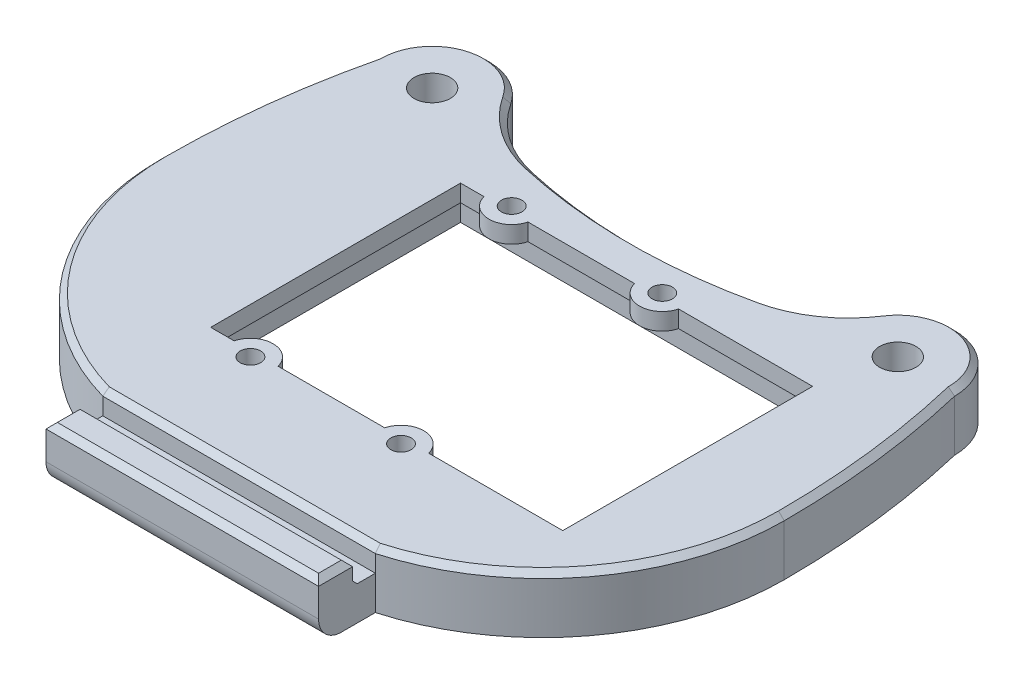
ISO-10303-21;
HEADER;
FILE_DESCRIPTION(('STEP AP214'),'2;1');
FILE_NAME('part.step','',(''),(''),'','','');
FILE_SCHEMA(('AUTOMOTIVE_DESIGN { 1 0 10303 214 1 1 1 1 }'));
ENDSEC;
DATA;
#1=APPLICATION_CONTEXT('core data for automotive mechanical design processes');
#2=APPLICATION_PROTOCOL_DEFINITION('international standard','automotive_design',2000,#1);
#3=PRODUCT_CONTEXT('',#1,'mechanical');
#4=PRODUCT('Part','Part','',(#3));
#5=PRODUCT_RELATED_PRODUCT_CATEGORY('part','',(#4));
#6=PRODUCT_DEFINITION_FORMATION('','',#4);
#7=PRODUCT_DEFINITION_CONTEXT('part definition',#1,'design');
#8=PRODUCT_DEFINITION('design','',#6,#7);
#9=PRODUCT_DEFINITION_SHAPE('','',#8);
#10=(LENGTH_UNIT() NAMED_UNIT(*) SI_UNIT(.MILLI.,.METRE.));
#11=(NAMED_UNIT(*) PLANE_ANGLE_UNIT() SI_UNIT($,.RADIAN.));
#12=(NAMED_UNIT(*) SI_UNIT($,.STERADIAN.) SOLID_ANGLE_UNIT());
#13=UNCERTAINTY_MEASURE_WITH_UNIT(LENGTH_MEASURE(1.E-05),#10,'distance_accuracy_value','');
#14=(GEOMETRIC_REPRESENTATION_CONTEXT(3) GLOBAL_UNCERTAINTY_ASSIGNED_CONTEXT((#13)) GLOBAL_UNIT_ASSIGNED_CONTEXT((#10,
#11,#12)) REPRESENTATION_CONTEXT('',''));
#15=CARTESIAN_POINT('',(0.,0.,0.));
#16=DIRECTION('',(0.,0.,1.));
#17=DIRECTION('',(1.,0.,0.));
#18=AXIS2_PLACEMENT_3D('',#15,#16,#17);
#19=CARTESIAN_POINT('',(0.,5.,20.5));
#20=DIRECTION('',(0.,0.,-1.));
#21=DIRECTION('',(-1.,0.,0.));
#22=AXIS2_PLACEMENT_3D('',#19,#20,#21);
#23=PLANE('',#22);
#24=DIRECTION('',(0.,-1.,0.));
#25=VECTOR('',#24,1.);
#26=CARTESIAN_POINT('',(24.,5.,20.5));
#27=LINE('',#26,#25);
#28=CARTESIAN_POINT('',(24.,4.50000000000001,20.5));
#29=VERTEX_POINT('',#28);
#30=CARTESIAN_POINT('',(24.,3.,20.5));
#31=VERTEX_POINT('',#30);
#32=EDGE_CURVE('E1077',#29,#31,#27,.T.);
#33=ORIENTED_EDGE('',*,*,#32,.F.);
#34=DIRECTION('',(-1.,0.,0.));
#35=VECTOR('',#34,1.);
#36=CARTESIAN_POINT('',(0.,4.5,20.5));
#37=LINE('',#36,#35);
#38=CARTESIAN_POINT('',(0.,4.50000000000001,20.5));
#39=VERTEX_POINT('',#38);
#40=EDGE_CURVE('E1179',#29,#39,#37,.T.);
#41=ORIENTED_EDGE('',*,*,#40,.T.);
#42=DIRECTION('',(0.,-1.,0.));
#43=VECTOR('',#42,1.);
#44=CARTESIAN_POINT('',(0.,5.,20.5));
#45=LINE('',#44,#43);
#46=CARTESIAN_POINT('',(0.,3.,20.5));
#47=VERTEX_POINT('',#46);
#48=EDGE_CURVE('E1113',#39,#47,#45,.T.);
#49=ORIENTED_EDGE('',*,*,#48,.T.);
#50=DIRECTION('',(-1.,0.,0.));
#51=VECTOR('',#50,1.);
#52=CARTESIAN_POINT('',(24.,3.,20.5));
#53=LINE('',#52,#51);
#54=EDGE_CURVE('E813',#31,#47,#53,.T.);
#55=ORIENTED_EDGE('',*,*,#54,.F.);
#56=EDGE_LOOP('',(#33,#41,#49,#55));
#57=FACE_BOUND('',#56,.T.);
#58=ADVANCED_FACE('F533',(#57),#23,.F.);
#59=CARTESIAN_POINT('',(0.,0.,0.));
#60=DIRECTION('',(0.,1.,0.));
#61=DIRECTION('',(0.,0.,1.));
#62=AXIS2_PLACEMENT_3D('',#59,#60,#61);
#63=PLANE('',#62);
#64=CARTESIAN_POINT('',(18.1935483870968,0.,0.));
#65=DIRECTION('',(0.,1.,0.));
#66=DIRECTION('',(0.,0.,1.));
#67=AXIS2_PLACEMENT_3D('',#64,#65,#66);
#68=CIRCLE('',#67,21.3064516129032);
#69=CARTESIAN_POINT('',(39.5,0.,0.));
#70=VERTEX_POINT('',#69);
#71=CARTESIAN_POINT('',(24.,0.,20.5));
#72=VERTEX_POINT('',#71);
#73=EDGE_CURVE('E1067',#70,#72,#68,.F.);
#74=ORIENTED_EDGE('',*,*,#73,.T.);
#75=DIRECTION('',(0.,0.,-1.));
#76=VECTOR('',#75,1.);
#77=CARTESIAN_POINT('',(24.,0.,20.5));
#78=LINE('',#77,#76);
#79=CARTESIAN_POINT('',(24.,0.,23.5));
#80=VERTEX_POINT('',#79);
#81=EDGE_CURVE('E820',#80,#72,#78,.T.);
#82=ORIENTED_EDGE('',*,*,#81,.F.);
#83=DIRECTION('',(-1.,0.,0.));
#84=VECTOR('',#83,1.);
#85=CARTESIAN_POINT('',(24.,0.,23.5));
#86=LINE('',#85,#84);
#87=CARTESIAN_POINT('',(0.,0.,23.5));
#88=VERTEX_POINT('',#87);
#89=EDGE_CURVE('E814',#80,#88,#86,.T.);
#90=ORIENTED_EDGE('',*,*,#89,.T.);
#91=DIRECTION('',(0.,0.,-1.));
#92=VECTOR('',#91,1.);
#93=CARTESIAN_POINT('',(0.,0.,20.5));
#94=LINE('',#93,#92);
#95=CARTESIAN_POINT('',(0.,0.,20.5));
#96=VERTEX_POINT('',#95);
#97=EDGE_CURVE('E842',#88,#96,#94,.T.);
#98=ORIENTED_EDGE('',*,*,#97,.T.);
#99=CARTESIAN_POINT('',(5.80645161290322,0.,0.));
#100=DIRECTION('',(0.,1.,0.));
#101=DIRECTION('',(0.,0.,1.));
#102=AXIS2_PLACEMENT_3D('',#99,#100,#101);
#103=CIRCLE('',#102,21.3064516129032);
#104=CARTESIAN_POINT('',(-15.5,0.,0.));
#105=VERTEX_POINT('',#104);
#106=EDGE_CURVE('E1101',#105,#96,#103,.T.);
#107=ORIENTED_EDGE('',*,*,#106,.F.);
#108=CARTESIAN_POINT('',(57.7499999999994,0.,0.));
#109=DIRECTION('',(0.,1.,0.));
#110=DIRECTION('',(0.,0.,1.));
#111=AXIS2_PLACEMENT_3D('',#108,#109,#110);
#112=CIRCLE('',#111,73.2499999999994);
#113=CARTESIAN_POINT('',(-13.5,0.,-17.));
#114=VERTEX_POINT('',#113);
#115=EDGE_CURVE('E1097',#114,#105,#112,.T.);
#116=ORIENTED_EDGE('',*,*,#115,.F.);
#117=CARTESIAN_POINT('',(-8.5,0.,-17.));
#118=DIRECTION('',(0.,1.,0.));
#119=DIRECTION('',(0.,0.,1.));
#120=AXIS2_PLACEMENT_3D('',#117,#118,#119);
#121=CIRCLE('',#120,5.);
#122=CARTESIAN_POINT('',(-4.31409561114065,0.,-19.7346305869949));
#123=VERTEX_POINT('',#122);
#124=EDGE_CURVE('E1093',#114,#123,#121,.F.);
#125=ORIENTED_EDGE('',*,*,#124,.T.);
#126=CARTESIAN_POINT('',(4.05771316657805,0.,-25.2038917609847));
#127=DIRECTION('',(0.,1.,0.));
#128=DIRECTION('',(0.,0.,1.));
#129=AXIS2_PLACEMENT_3D('',#126,#127,#128);
#130=CIRCLE('',#129,10.);
#131=CARTESIAN_POINT('',(1.86302116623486,0.,-15.4476974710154));
#132=VERTEX_POINT('',#131);
#133=EDGE_CURVE('E1145',#123,#132,#130,.T.);
#134=ORIENTED_EDGE('',*,*,#133,.T.);
#135=CARTESIAN_POINT('',(12.,0.,-60.5102096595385));
#136=DIRECTION('',(0.,1.,0.));
#137=DIRECTION('',(0.,0.,1.));
#138=AXIS2_PLACEMENT_3D('',#135,#136,#137);
#139=CIRCLE('',#138,46.1886170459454);
#140=CARTESIAN_POINT('',(22.1369788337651,0.,-15.4476974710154));
#141=VERTEX_POINT('',#140);
#142=EDGE_CURVE('E1089',#132,#141,#139,.T.);
#143=ORIENTED_EDGE('',*,*,#142,.T.);
#144=CARTESIAN_POINT('',(19.9422868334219,0.,-25.2038917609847));
#145=DIRECTION('',(0.,1.,0.));
#146=DIRECTION('',(0.,0.,1.));
#147=AXIS2_PLACEMENT_3D('',#144,#145,#146);
#148=CIRCLE('',#147,10.);
#149=CARTESIAN_POINT('',(28.3140956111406,0.,-19.7346305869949));
#150=VERTEX_POINT('',#149);
#151=EDGE_CURVE('E1142',#141,#150,#148,.T.);
#152=ORIENTED_EDGE('',*,*,#151,.T.);
#153=CARTESIAN_POINT('',(32.5,0.,-17.));
#154=DIRECTION('',(0.,1.,0.));
#155=DIRECTION('',(0.,0.,1.));
#156=AXIS2_PLACEMENT_3D('',#153,#154,#155);
#157=CIRCLE('',#156,5.);
#158=CARTESIAN_POINT('',(37.5,0.,-17.));
#159=VERTEX_POINT('',#158);
#160=EDGE_CURVE('E1085',#150,#159,#157,.F.);
#161=ORIENTED_EDGE('',*,*,#160,.T.);
#162=CARTESIAN_POINT('',(-33.7500000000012,0.,1.75207071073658E-13));
#163=DIRECTION('',(0.,1.,0.));
#164=DIRECTION('',(0.,0.,1.));
#165=AXIS2_PLACEMENT_3D('',#162,#163,#164);
#166=CIRCLE('',#165,73.2500000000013);
#167=EDGE_CURVE('E1081',#159,#70,#166,.F.);
#168=ORIENTED_EDGE('',*,*,#167,.T.);
#169=EDGE_LOOP('',(#74,#82,#90,#98,#107,#116,#125,#134,#143,#152,#161,#168));
#170=FACE_BOUND('',#169,.T.);
#171=CARTESIAN_POINT('',(32.5,0.,-17.));
#172=DIRECTION('',(0.,1.,0.));
#173=DIRECTION('',(0.,0.,1.));
#174=AXIS2_PLACEMENT_3D('',#171,#172,#173);
#175=CIRCLE('',#174,1.6);
#176=CARTESIAN_POINT('',(32.5,0.,-15.4));
#177=VERTEX_POINT('',#176);
#178=EDGE_CURVE('E1104',#177,#177,#175,.T.);
#179=ORIENTED_EDGE('',*,*,#178,.T.);
#180=EDGE_LOOP('',(#179));
#181=FACE_BOUND('',#180,.T.);
#182=CARTESIAN_POINT('',(-8.5,0.,-17.));
#183=DIRECTION('',(0.,1.,0.));
#184=DIRECTION('',(0.,0.,1.));
#185=AXIS2_PLACEMENT_3D('',#182,#183,#184);
#186=CIRCLE('',#185,1.6);
#187=CARTESIAN_POINT('',(-8.5,0.,-15.4));
#188=VERTEX_POINT('',#187);
#189=EDGE_CURVE('E1073',#188,#188,#186,.T.);
#190=ORIENTED_EDGE('',*,*,#189,.T.);
#191=EDGE_LOOP('',(#190));
#192=FACE_BOUND('',#191,.T.);
#193=DIRECTION('',(0.,0.,1.));
#194=VECTOR('',#193,1.);
#195=CARTESIAN_POINT('',(-2.,0.,0.));
#196=LINE('',#195,#194);
#197=CARTESIAN_POINT('',(-2.,0.,-13.));
#198=VERTEX_POINT('',#197);
#199=CARTESIAN_POINT('',(-2.,0.,13.));
#200=VERTEX_POINT('',#199);
#201=EDGE_CURVE('E911',#198,#200,#196,.T.);
#202=ORIENTED_EDGE('',*,*,#201,.T.);
#203=DIRECTION('',(1.,0.,0.));
#204=VECTOR('',#203,1.);
#205=CARTESIAN_POINT('',(0.,0.,13.));
#206=LINE('',#205,#204);
#207=CARTESIAN_POINT('',(33.,0.,13.));
#208=VERTEX_POINT('',#207);
#209=EDGE_CURVE('E932',#200,#208,#206,.T.);
#210=ORIENTED_EDGE('',*,*,#209,.T.);
#211=DIRECTION('',(0.,0.,1.));
#212=VECTOR('',#211,1.);
#213=CARTESIAN_POINT('',(33.,0.,0.));
#214=LINE('',#213,#212);
#215=CARTESIAN_POINT('',(33.,0.,-13.));
#216=VERTEX_POINT('',#215);
#217=EDGE_CURVE('E936',#216,#208,#214,.T.);
#218=ORIENTED_EDGE('',*,*,#217,.F.);
#219=DIRECTION('',(1.,0.,0.));
#220=VECTOR('',#219,1.);
#221=CARTESIAN_POINT('',(0.,0.,-13.));
#222=LINE('',#221,#220);
#223=EDGE_CURVE('E917',#198,#216,#222,.T.);
#224=ORIENTED_EDGE('',*,*,#223,.F.);
#225=EDGE_LOOP('',(#202,#210,#218,#224));
#226=FACE_BOUND('',#225,.T.);
#227=ADVANCED_FACE('F1370',(#170,#181,#192,#226),#63,.F.);
#228=CARTESIAN_POINT('',(0.,5.,0.));
#229=DIRECTION('',(0.,1.,0.));
#230=DIRECTION('',(0.,0.,1.));
#231=AXIS2_PLACEMENT_3D('',#228,#229,#230);
#232=PLANE('',#231);
#233=CARTESIAN_POINT('',(5.80645161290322,5.,0.));
#234=DIRECTION('',(0.,1.,0.));
#235=DIRECTION('',(0.,0.,1.));
#236=AXIS2_PLACEMENT_3D('',#233,#234,#235);
#237=CIRCLE('',#236,20.8064516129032);
#238=CARTESIAN_POINT('',(-15.,5.,0.));
#239=VERTEX_POINT('',#238);
#240=CARTESIAN_POINT('',(0.0698647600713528,5.,20.));
#241=VERTEX_POINT('',#240);
#242=EDGE_CURVE('E1169',#239,#241,#237,.T.);
#243=ORIENTED_EDGE('',*,*,#242,.T.);
#244=DIRECTION('',(1.,0.,0.));
#245=VECTOR('',#244,1.);
#246=CARTESIAN_POINT('',(24.,5.,20.));
#247=LINE('',#246,#245);
#248=CARTESIAN_POINT('',(23.9301352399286,5.,20.));
#249=VERTEX_POINT('',#248);
#250=EDGE_CURVE('E1175',#241,#249,#247,.T.);
#251=ORIENTED_EDGE('',*,*,#250,.T.);
#252=CARTESIAN_POINT('',(18.1935483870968,5.,0.));
#253=DIRECTION('',(0.,1.,0.));
#254=DIRECTION('',(0.,0.,1.));
#255=AXIS2_PLACEMENT_3D('',#252,#253,#254);
#256=CIRCLE('',#255,20.8064516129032);
#257=CARTESIAN_POINT('',(39.,5.,0.));
#258=VERTEX_POINT('',#257);
#259=EDGE_CURVE('E1172',#249,#258,#256,.T.);
#260=ORIENTED_EDGE('',*,*,#259,.T.);
#261=CARTESIAN_POINT('',(-33.7500000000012,5.,1.75207071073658E-13));
#262=DIRECTION('',(0.,1.,0.));
#263=DIRECTION('',(0.,0.,1.));
#264=AXIS2_PLACEMENT_3D('',#261,#262,#263);
#265=CIRCLE('',#264,72.7500000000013);
#266=CARTESIAN_POINT('',(36.9996339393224,5.,-16.9426030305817));
#267=VERTEX_POINT('',#266);
#268=EDGE_CURVE('E1166',#258,#267,#265,.T.);
#269=ORIENTED_EDGE('',*,*,#268,.T.);
#270=CARTESIAN_POINT('',(32.5,5.,-17.));
#271=DIRECTION('',(0.,1.,0.));
#272=DIRECTION('',(0.,0.,1.));
#273=AXIS2_PLACEMENT_3D('',#270,#271,#272);
#274=CIRCLE('',#273,4.5);
#275=CARTESIAN_POINT('',(28.7326860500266,5.,-19.4611675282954));
#276=VERTEX_POINT('',#275);
#277=EDGE_CURVE('E1163',#267,#276,#274,.T.);
#278=ORIENTED_EDGE('',*,*,#277,.T.);
#279=CARTESIAN_POINT('',(19.9422868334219,5.,-25.2038917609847));
#280=DIRECTION('',(0.,1.,0.));
#281=DIRECTION('',(0.,0.,1.));
#282=AXIS2_PLACEMENT_3D('',#279,#280,#281);
#283=CIRCLE('',#282,10.5);
#284=CARTESIAN_POINT('',(22.2467134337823,5.,-14.9598877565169));
#285=VERTEX_POINT('',#284);
#286=EDGE_CURVE('E1160',#276,#285,#283,.F.);
#287=ORIENTED_EDGE('',*,*,#286,.T.);
#288=CARTESIAN_POINT('',(12.,5.,-60.5102096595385));
#289=DIRECTION('',(0.,1.,0.));
#290=DIRECTION('',(0.,0.,1.));
#291=AXIS2_PLACEMENT_3D('',#288,#289,#290);
#292=CIRCLE('',#291,46.6886170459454);
#293=CARTESIAN_POINT('',(1.7532865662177,5.,-14.9598877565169));
#294=VERTEX_POINT('',#293);
#295=EDGE_CURVE('E1157',#285,#294,#292,.F.);
#296=ORIENTED_EDGE('',*,*,#295,.T.);
#297=CARTESIAN_POINT('',(4.05771316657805,5.,-25.2038917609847));
#298=DIRECTION('',(0.,1.,0.));
#299=DIRECTION('',(0.,0.,1.));
#300=AXIS2_PLACEMENT_3D('',#297,#298,#299);
#301=CIRCLE('',#300,10.5);
#302=CARTESIAN_POINT('',(-4.73268605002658,5.,-19.4611675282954));
#303=VERTEX_POINT('',#302);
#304=EDGE_CURVE('E1154',#294,#303,#301,.F.);
#305=ORIENTED_EDGE('',*,*,#304,.T.);
#306=CARTESIAN_POINT('',(-8.5,5.,-17.));
#307=DIRECTION('',(0.,1.,0.));
#308=DIRECTION('',(0.,0.,1.));
#309=AXIS2_PLACEMENT_3D('',#306,#307,#308);
#310=CIRCLE('',#309,4.5);
#311=CARTESIAN_POINT('',(-12.9996339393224,5.,-16.9426030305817));
#312=VERTEX_POINT('',#311);
#313=EDGE_CURVE('E1151',#303,#312,#310,.T.);
#314=ORIENTED_EDGE('',*,*,#313,.T.);
#315=CARTESIAN_POINT('',(57.7499999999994,5.,0.));
#316=DIRECTION('',(0.,1.,0.));
#317=DIRECTION('',(0.,0.,1.));
#318=AXIS2_PLACEMENT_3D('',#315,#316,#317);
#319=CIRCLE('',#318,72.7499999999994);
#320=EDGE_CURVE('E1148',#312,#239,#319,.T.);
#321=ORIENTED_EDGE('',*,*,#320,.T.);
#322=EDGE_LOOP('',(#243,#251,#260,#269,#278,#287,#296,#305,#314,#321));
#323=FACE_BOUND('',#322,.T.);
#324=CARTESIAN_POINT('',(17.26,5.,11.5));
#325=DIRECTION('',(0.,1.,0.));
#326=DIRECTION('',(0.,0.,1.));
#327=AXIS2_PLACEMENT_3D('',#324,#325,#326);
#328=CIRCLE('',#327,0.9);
#329=CARTESIAN_POINT('',(17.26,5.,12.4));
#330=VERTEX_POINT('',#329);
#331=EDGE_CURVE('E966',#330,#330,#328,.T.);
#332=ORIENTED_EDGE('',*,*,#331,.F.);
#333=EDGE_LOOP('',(#332));
#334=FACE_BOUND('',#333,.T.);
#335=CARTESIAN_POINT('',(4.,5.,-11.5));
#336=DIRECTION('',(0.,1.,0.));
#337=DIRECTION('',(0.,0.,1.));
#338=AXIS2_PLACEMENT_3D('',#335,#336,#337);
#339=CIRCLE('',#338,0.899999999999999);
#340=CARTESIAN_POINT('',(4.,5.,-10.6));
#341=VERTEX_POINT('',#340);
#342=EDGE_CURVE('E957',#341,#341,#339,.T.);
#343=ORIENTED_EDGE('',*,*,#342,.F.);
#344=EDGE_LOOP('',(#343));
#345=FACE_BOUND('',#344,.T.);
#346=CARTESIAN_POINT('',(-8.5,5.,-17.));
#347=DIRECTION('',(0.,1.,0.));
#348=DIRECTION('',(0.,0.,1.));
#349=AXIS2_PLACEMENT_3D('',#346,#347,#348);
#350=CIRCLE('',#349,1.6);
#351=CARTESIAN_POINT('',(-8.5,5.,-15.4));
#352=VERTEX_POINT('',#351);
#353=EDGE_CURVE('E1072',#352,#352,#350,.T.);
#354=ORIENTED_EDGE('',*,*,#353,.F.);
#355=EDGE_LOOP('',(#354));
#356=FACE_BOUND('',#355,.T.);
#357=CARTESIAN_POINT('',(32.5,5.,-17.));
#358=DIRECTION('',(0.,1.,0.));
#359=DIRECTION('',(0.,0.,1.));
#360=AXIS2_PLACEMENT_3D('',#357,#358,#359);
#361=CIRCLE('',#360,1.6);
#362=CARTESIAN_POINT('',(32.5,5.,-15.4));
#363=VERTEX_POINT('',#362);
#364=EDGE_CURVE('E1068',#363,#363,#361,.T.);
#365=ORIENTED_EDGE('',*,*,#364,.F.);
#366=EDGE_LOOP('',(#365));
#367=FACE_BOUND('',#366,.T.);
#368=CARTESIAN_POINT('',(4.,5.,11.5));
#369=DIRECTION('',(0.,1.,0.));
#370=DIRECTION('',(0.,0.,1.));
#371=AXIS2_PLACEMENT_3D('',#368,#369,#370);
#372=CIRCLE('',#371,2.);
#373=CARTESIAN_POINT('',(5.93649167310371,5.,11.));
#374=VERTEX_POINT('',#373);
#375=CARTESIAN_POINT('',(2.06350832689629,5.,11.));
#376=VERTEX_POINT('',#375);
#377=EDGE_CURVE('E1011',#374,#376,#372,.T.);
#378=ORIENTED_EDGE('',*,*,#377,.T.);
#379=DIRECTION('',(1.,0.,0.));
#380=VECTOR('',#379,1.);
#381=CARTESIAN_POINT('',(0.,5.,11.));
#382=LINE('',#381,#380);
#383=CARTESIAN_POINT('',(0.,5.,11.));
#384=VERTEX_POINT('',#383);
#385=EDGE_CURVE('E1015',#384,#376,#382,.T.);
#386=ORIENTED_EDGE('',*,*,#385,.F.);
#387=DIRECTION('',(0.,0.,1.));
#388=VECTOR('',#387,1.);
#389=CARTESIAN_POINT('',(0.,5.,0.));
#390=LINE('',#389,#388);
#391=CARTESIAN_POINT('',(0.,5.,-11.));
#392=VERTEX_POINT('',#391);
#393=EDGE_CURVE('E961',#392,#384,#390,.T.);
#394=ORIENTED_EDGE('',*,*,#393,.F.);
#395=DIRECTION('',(-1.,0.,0.));
#396=VECTOR('',#395,1.);
#397=CARTESIAN_POINT('',(0.,5.,-11.));
#398=LINE('',#397,#396);
#399=CARTESIAN_POINT('',(2.06350832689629,5.,-11.));
#400=VERTEX_POINT('',#399);
#401=EDGE_CURVE('E976',#400,#392,#398,.T.);
#402=ORIENTED_EDGE('',*,*,#401,.F.);
#403=CARTESIAN_POINT('',(4.,5.,-11.5));
#404=DIRECTION('',(0.,1.,0.));
#405=DIRECTION('',(0.,0.,1.));
#406=AXIS2_PLACEMENT_3D('',#403,#404,#405);
#407=CIRCLE('',#406,2.);
#408=CARTESIAN_POINT('',(5.93649167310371,5.,-11.));
#409=VERTEX_POINT('',#408);
#410=EDGE_CURVE('E979',#400,#409,#407,.T.);
#411=ORIENTED_EDGE('',*,*,#410,.T.);
#412=DIRECTION('',(-1.,0.,0.));
#413=VECTOR('',#412,1.);
#414=CARTESIAN_POINT('',(0.,5.,-11.));
#415=LINE('',#414,#413);
#416=CARTESIAN_POINT('',(15.3235083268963,5.,-11.));
#417=VERTEX_POINT('',#416);
#418=EDGE_CURVE('E983',#417,#409,#415,.T.);
#419=ORIENTED_EDGE('',*,*,#418,.F.);
#420=CARTESIAN_POINT('',(17.26,5.,-11.5));
#421=DIRECTION('',(0.,1.,0.));
#422=DIRECTION('',(0.,0.,1.));
#423=AXIS2_PLACEMENT_3D('',#420,#421,#422);
#424=CIRCLE('',#423,2.);
#425=CARTESIAN_POINT('',(19.1964916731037,5.,-11.));
#426=VERTEX_POINT('',#425);
#427=EDGE_CURVE('E987',#417,#426,#424,.T.);
#428=ORIENTED_EDGE('',*,*,#427,.T.);
#429=DIRECTION('',(-1.,0.,0.));
#430=VECTOR('',#429,1.);
#431=CARTESIAN_POINT('',(0.,5.,-11.));
#432=LINE('',#431,#430);
#433=CARTESIAN_POINT('',(31.,5.,-11.));
#434=VERTEX_POINT('',#433);
#435=EDGE_CURVE('E991',#434,#426,#432,.T.);
#436=ORIENTED_EDGE('',*,*,#435,.F.);
#437=DIRECTION('',(0.,0.,1.));
#438=VECTOR('',#437,1.);
#439=CARTESIAN_POINT('',(31.,5.,0.));
#440=LINE('',#439,#438);
#441=CARTESIAN_POINT('',(31.,5.,11.));
#442=VERTEX_POINT('',#441);
#443=EDGE_CURVE('E995',#434,#442,#440,.T.);
#444=ORIENTED_EDGE('',*,*,#443,.T.);
#445=DIRECTION('',(-1.,0.,0.));
#446=VECTOR('',#445,1.);
#447=CARTESIAN_POINT('',(0.,5.,11.));
#448=LINE('',#447,#446);
#449=CARTESIAN_POINT('',(19.1964916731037,5.,11.));
#450=VERTEX_POINT('',#449);
#451=EDGE_CURVE('E999',#442,#450,#448,.T.);
#452=ORIENTED_EDGE('',*,*,#451,.T.);
#453=CARTESIAN_POINT('',(17.26,5.,11.5));
#454=DIRECTION('',(0.,1.,0.));
#455=DIRECTION('',(0.,0.,1.));
#456=AXIS2_PLACEMENT_3D('',#453,#454,#455);
#457=CIRCLE('',#456,2.);
#458=CARTESIAN_POINT('',(15.3235083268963,5.,11.));
#459=VERTEX_POINT('',#458);
#460=EDGE_CURVE('E1003',#450,#459,#457,.T.);
#461=ORIENTED_EDGE('',*,*,#460,.T.);
#462=DIRECTION('',(-1.,0.,0.));
#463=VECTOR('',#462,1.);
#464=CARTESIAN_POINT('',(0.,5.,11.));
#465=LINE('',#464,#463);
#466=EDGE_CURVE('E1007',#459,#374,#465,.T.);
#467=ORIENTED_EDGE('',*,*,#466,.T.);
#468=EDGE_LOOP('',(#378,#386,#394,#402,#411,#419,#428,#436,#444,#452,#461,#467));
#469=FACE_BOUND('',#468,.T.);
#470=CARTESIAN_POINT('',(17.26,5.,-11.5));
#471=DIRECTION('',(0.,1.,0.));
#472=DIRECTION('',(0.,0.,1.));
#473=AXIS2_PLACEMENT_3D('',#470,#471,#472);
#474=CIRCLE('',#473,0.9);
#475=CARTESIAN_POINT('',(17.26,5.,-10.6));
#476=VERTEX_POINT('',#475);
#477=EDGE_CURVE('E962',#476,#476,#474,.T.);
#478=ORIENTED_EDGE('',*,*,#477,.F.);
#479=EDGE_LOOP('',(#478));
#480=FACE_BOUND('',#479,.T.);
#481=CARTESIAN_POINT('',(4.,5.,11.5));
#482=DIRECTION('',(0.,1.,0.));
#483=DIRECTION('',(0.,0.,1.));
#484=AXIS2_PLACEMENT_3D('',#481,#482,#483);
#485=CIRCLE('',#484,0.899999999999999);
#486=CARTESIAN_POINT('',(4.,5.,12.4));
#487=VERTEX_POINT('',#486);
#488=EDGE_CURVE('E956',#487,#487,#485,.T.);
#489=ORIENTED_EDGE('',*,*,#488,.F.);
#490=EDGE_LOOP('',(#489));
#491=FACE_BOUND('',#490,.T.);
#492=ADVANCED_FACE('F1376',(#323,#334,#345,#356,#367,#469,#480,#491),#232,.T.);
#493=CARTESIAN_POINT('',(-8.5,5.,-17.));
#494=DIRECTION('',(0.,-1.,0.));
#495=DIRECTION('',(0.,0.,-1.));
#496=AXIS2_PLACEMENT_3D('',#493,#494,#495);
#497=CYLINDRICAL_SURFACE('',#496,1.6);
#498=ORIENTED_EDGE('',*,*,#353,.T.);
#499=EDGE_LOOP('',(#498));
#500=FACE_BOUND('',#499,.T.);
#501=ORIENTED_EDGE('',*,*,#189,.F.);
#502=EDGE_LOOP('',(#501));
#503=FACE_BOUND('',#502,.T.);
#504=ADVANCED_FACE('F1580',(#500,#503),#497,.F.);
#505=CARTESIAN_POINT('',(32.5,5.,-17.));
#506=DIRECTION('',(0.,-1.,0.));
#507=DIRECTION('',(0.,0.,-1.));
#508=AXIS2_PLACEMENT_3D('',#505,#506,#507);
#509=CYLINDRICAL_SURFACE('',#508,1.6);
#510=ORIENTED_EDGE('',*,*,#364,.T.);
#511=EDGE_LOOP('',(#510));
#512=FACE_BOUND('',#511,.T.);
#513=ORIENTED_EDGE('',*,*,#178,.F.);
#514=EDGE_LOOP('',(#513));
#515=FACE_BOUND('',#514,.T.);
#516=ADVANCED_FACE('F1382',(#512,#515),#509,.F.);
#517=CARTESIAN_POINT('',(-33.7500000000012,5.,1.75207071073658E-13));
#518=DIRECTION('',(0.,-1.,0.));
#519=DIRECTION('',(0.,0.,-1.));
#520=AXIS2_PLACEMENT_3D('',#517,#518,#519);
#521=CYLINDRICAL_SURFACE('',#520,73.2500000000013);
#522=DIRECTION('',(0.,-1.,0.));
#523=VECTOR('',#522,1.);
#524=CARTESIAN_POINT('',(37.5,5.,-17.));
#525=LINE('',#524,#523);
#526=CARTESIAN_POINT('',(37.5,4.50000000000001,-17.));
#527=VERTEX_POINT('',#526);
#528=EDGE_CURVE('E1122',#527,#159,#525,.T.);
#529=ORIENTED_EDGE('',*,*,#528,.F.);
#530=CARTESIAN_POINT('',(-33.7500000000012,4.50000000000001,1.75207071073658E-13));
#531=DIRECTION('',(0.,1.,0.));
#532=DIRECTION('',(0.,0.,1.));
#533=AXIS2_PLACEMENT_3D('',#530,#531,#532);
#534=CIRCLE('',#533,73.2500000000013);
#535=CARTESIAN_POINT('',(39.5,4.50000000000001,0.));
#536=VERTEX_POINT('',#535);
#537=EDGE_CURVE('E1215',#527,#536,#534,.F.);
#538=ORIENTED_EDGE('',*,*,#537,.T.);
#539=DIRECTION('',(0.,-1.,0.));
#540=VECTOR('',#539,1.);
#541=CARTESIAN_POINT('',(39.5,5.,0.));
#542=LINE('',#541,#540);
#543=EDGE_CURVE('E1125',#536,#70,#542,.T.);
#544=ORIENTED_EDGE('',*,*,#543,.T.);
#545=ORIENTED_EDGE('',*,*,#167,.F.);
#546=EDGE_LOOP('',(#529,#538,#544,#545));
#547=FACE_BOUND('',#546,.T.);
#548=ADVANCED_FACE('F1404',(#547),#521,.T.);
#549=CARTESIAN_POINT('',(32.5,5.,-17.));
#550=DIRECTION('',(0.,-1.,0.));
#551=DIRECTION('',(0.,0.,-1.));
#552=AXIS2_PLACEMENT_3D('',#549,#550,#551);
#553=CYLINDRICAL_SURFACE('',#552,5.);
#554=DIRECTION('',(0.,-1.,0.));
#555=VECTOR('',#554,1.);
#556=CARTESIAN_POINT('',(28.3140956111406,5.,-19.7346305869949));
#557=LINE('',#556,#555);
#558=CARTESIAN_POINT('',(28.3140956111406,4.50000000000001,-19.7346305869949));
#559=VERTEX_POINT('',#558);
#560=EDGE_CURVE('E1135',#150,#559,#557,.F.);
#561=ORIENTED_EDGE('',*,*,#560,.T.);
#562=CARTESIAN_POINT('',(32.5,4.50000000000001,-17.));
#563=DIRECTION('',(0.,1.,0.));
#564=DIRECTION('',(0.,0.,1.));
#565=AXIS2_PLACEMENT_3D('',#562,#563,#564);
#566=CIRCLE('',#565,5.);
#567=EDGE_CURVE('E1218',#559,#527,#566,.F.);
#568=ORIENTED_EDGE('',*,*,#567,.T.);
#569=ORIENTED_EDGE('',*,*,#528,.T.);
#570=ORIENTED_EDGE('',*,*,#160,.F.);
#571=EDGE_LOOP('',(#561,#568,#569,#570));
#572=FACE_BOUND('',#571,.T.);
#573=ADVANCED_FACE('F1400',(#572),#553,.T.);
#574=CARTESIAN_POINT('',(12.,5.,-60.5102096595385));
#575=DIRECTION('',(0.,-1.,0.));
#576=DIRECTION('',(0.,0.,-1.));
#577=AXIS2_PLACEMENT_3D('',#574,#575,#576);
#578=CYLINDRICAL_SURFACE('',#577,46.1886170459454);
#579=DIRECTION('',(0.,-1.,0.));
#580=VECTOR('',#579,1.);
#581=CARTESIAN_POINT('',(1.86302116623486,5.,-15.4476974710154));
#582=LINE('',#581,#580);
#583=CARTESIAN_POINT('',(1.86302116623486,4.50000000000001,-15.4476974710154));
#584=VERTEX_POINT('',#583);
#585=EDGE_CURVE('E1128',#132,#584,#582,.F.);
#586=ORIENTED_EDGE('',*,*,#585,.T.);
#587=CARTESIAN_POINT('',(12.,4.50000000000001,-60.5102096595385));
#588=DIRECTION('',(0.,1.,0.));
#589=DIRECTION('',(0.,0.,1.));
#590=AXIS2_PLACEMENT_3D('',#587,#588,#589);
#591=CIRCLE('',#590,46.1886170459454);
#592=CARTESIAN_POINT('',(22.1369788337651,4.50000000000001,-15.4476974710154));
#593=VERTEX_POINT('',#592);
#594=EDGE_CURVE('E1224',#584,#593,#591,.T.);
#595=ORIENTED_EDGE('',*,*,#594,.T.);
#596=DIRECTION('',(0.,-1.,0.));
#597=VECTOR('',#596,1.);
#598=CARTESIAN_POINT('',(22.1369788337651,5.,-15.4476974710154));
#599=LINE('',#598,#597);
#600=EDGE_CURVE('E1132',#593,#141,#599,.T.);
#601=ORIENTED_EDGE('',*,*,#600,.T.);
#602=ORIENTED_EDGE('',*,*,#142,.F.);
#603=EDGE_LOOP('',(#586,#595,#601,#602));
#604=FACE_BOUND('',#603,.T.);
#605=ADVANCED_FACE('F1396',(#604),#578,.F.);
#606=CARTESIAN_POINT('',(-8.5,5.,-17.));
#607=DIRECTION('',(0.,-1.,0.));
#608=DIRECTION('',(0.,0.,-1.));
#609=AXIS2_PLACEMENT_3D('',#606,#607,#608);
#610=CYLINDRICAL_SURFACE('',#609,5.);
#611=DIRECTION('',(0.,-1.,0.));
#612=VECTOR('',#611,1.);
#613=CARTESIAN_POINT('',(-13.5,5.,-17.));
#614=LINE('',#613,#612);
#615=CARTESIAN_POINT('',(-13.5,4.50000000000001,-17.));
#616=VERTEX_POINT('',#615);
#617=EDGE_CURVE('E1119',#616,#114,#614,.T.);
#618=ORIENTED_EDGE('',*,*,#617,.F.);
#619=CARTESIAN_POINT('',(-8.5,4.50000000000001,-17.));
#620=DIRECTION('',(0.,1.,0.));
#621=DIRECTION('',(0.,0.,1.));
#622=AXIS2_PLACEMENT_3D('',#619,#620,#621);
#623=CIRCLE('',#622,5.);
#624=CARTESIAN_POINT('',(-4.31409561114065,4.50000000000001,-19.7346305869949));
#625=VERTEX_POINT('',#624);
#626=EDGE_CURVE('E1230',#616,#625,#623,.F.);
#627=ORIENTED_EDGE('',*,*,#626,.T.);
#628=DIRECTION('',(0.,-1.,0.));
#629=VECTOR('',#628,1.);
#630=CARTESIAN_POINT('',(-4.31409561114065,5.,-19.7346305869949));
#631=LINE('',#630,#629);
#632=EDGE_CURVE('E1139',#625,#123,#631,.T.);
#633=ORIENTED_EDGE('',*,*,#632,.T.);
#634=ORIENTED_EDGE('',*,*,#124,.F.);
#635=EDGE_LOOP('',(#618,#627,#633,#634));
#636=FACE_BOUND('',#635,.T.);
#637=ADVANCED_FACE('F1392',(#636),#610,.T.);
#638=CARTESIAN_POINT('',(57.7499999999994,5.,0.));
#639=DIRECTION('',(0.,-1.,0.));
#640=DIRECTION('',(0.,0.,-1.));
#641=AXIS2_PLACEMENT_3D('',#638,#639,#640);
#642=CYLINDRICAL_SURFACE('',#641,73.2499999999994);
#643=DIRECTION('',(0.,-1.,0.));
#644=VECTOR('',#643,1.);
#645=CARTESIAN_POINT('',(-15.5,5.,0.));
#646=LINE('',#645,#644);
#647=CARTESIAN_POINT('',(-15.5,4.50000000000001,0.));
#648=VERTEX_POINT('',#647);
#649=EDGE_CURVE('E1116',#648,#105,#646,.T.);
#650=ORIENTED_EDGE('',*,*,#649,.F.);
#651=CARTESIAN_POINT('',(57.7499999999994,4.50000000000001,0.));
#652=DIRECTION('',(0.,1.,0.));
#653=DIRECTION('',(0.,0.,1.));
#654=AXIS2_PLACEMENT_3D('',#651,#652,#653);
#655=CIRCLE('',#654,73.2499999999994);
#656=EDGE_CURVE('E1233',#648,#616,#655,.F.);
#657=ORIENTED_EDGE('',*,*,#656,.T.);
#658=ORIENTED_EDGE('',*,*,#617,.T.);
#659=ORIENTED_EDGE('',*,*,#115,.T.);
#660=EDGE_LOOP('',(#650,#657,#658,#659));
#661=FACE_BOUND('',#660,.T.);
#662=ADVANCED_FACE('F1388',(#661),#642,.T.);
#663=CARTESIAN_POINT('',(5.80645161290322,5.,0.));
#664=DIRECTION('',(0.,-1.,0.));
#665=DIRECTION('',(0.,0.,-1.));
#666=AXIS2_PLACEMENT_3D('',#663,#664,#665);
#667=CYLINDRICAL_SURFACE('',#666,21.3064516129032);
#668=ORIENTED_EDGE('',*,*,#48,.F.);
#669=CARTESIAN_POINT('',(5.80645161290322,4.50000000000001,0.));
#670=DIRECTION('',(0.,1.,0.));
#671=DIRECTION('',(0.,0.,1.));
#672=AXIS2_PLACEMENT_3D('',#669,#670,#671);
#673=CIRCLE('',#672,21.3064516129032);
#674=EDGE_CURVE('E1212',#39,#648,#673,.F.);
#675=ORIENTED_EDGE('',*,*,#674,.T.);
#676=ORIENTED_EDGE('',*,*,#649,.T.);
#677=ORIENTED_EDGE('',*,*,#106,.T.);
#678=DIRECTION('',(0.,1.,0.));
#679=VECTOR('',#678,1.);
#680=CARTESIAN_POINT('',(0.,0.,20.5));
#681=LINE('',#680,#679);
#682=EDGE_CURVE('E826',#96,#47,#681,.T.);
#683=ORIENTED_EDGE('',*,*,#682,.T.);
#684=EDGE_LOOP('',(#668,#675,#676,#677,#683));
#685=FACE_BOUND('',#684,.T.);
#686=ADVANCED_FACE('F1384',(#685),#667,.T.);
#687=CARTESIAN_POINT('',(18.1935483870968,5.,0.));
#688=DIRECTION('',(0.,-1.,0.));
#689=DIRECTION('',(0.,0.,-1.));
#690=AXIS2_PLACEMENT_3D('',#687,#688,#689);
#691=CYLINDRICAL_SURFACE('',#690,21.3064516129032);
#692=ORIENTED_EDGE('',*,*,#543,.F.);
#693=CARTESIAN_POINT('',(18.1935483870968,4.50000000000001,0.));
#694=DIRECTION('',(0.,1.,0.));
#695=DIRECTION('',(0.,0.,1.));
#696=AXIS2_PLACEMENT_3D('',#693,#694,#695);
#697=CIRCLE('',#696,21.3064516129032);
#698=EDGE_CURVE('E1209',#536,#29,#697,.F.);
#699=ORIENTED_EDGE('',*,*,#698,.T.);
#700=ORIENTED_EDGE('',*,*,#32,.T.);
#701=DIRECTION('',(0.,1.,0.));
#702=VECTOR('',#701,1.);
#703=CARTESIAN_POINT('',(24.,0.,20.5));
#704=LINE('',#703,#702);
#705=EDGE_CURVE('E846',#72,#31,#704,.T.);
#706=ORIENTED_EDGE('',*,*,#705,.F.);
#707=ORIENTED_EDGE('',*,*,#73,.F.);
#708=EDGE_LOOP('',(#692,#699,#700,#706,#707));
#709=FACE_BOUND('',#708,.T.);
#710=ADVANCED_FACE('F1387',(#709),#691,.T.);
#711=CARTESIAN_POINT('',(19.9422868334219,5.,-25.2038917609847));
#712=DIRECTION('',(0.,-1.,0.));
#713=DIRECTION('',(0.,0.,-1.));
#714=AXIS2_PLACEMENT_3D('',#711,#712,#713);
#715=CYLINDRICAL_SURFACE('',#714,10.);
#716=ORIENTED_EDGE('',*,*,#600,.F.);
#717=CARTESIAN_POINT('',(19.9422868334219,4.50000000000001,-25.2038917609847));
#718=DIRECTION('',(0.,1.,0.));
#719=DIRECTION('',(0.,0.,1.));
#720=AXIS2_PLACEMENT_3D('',#717,#718,#719);
#721=CIRCLE('',#720,10.);
#722=EDGE_CURVE('E1221',#593,#559,#721,.T.);
#723=ORIENTED_EDGE('',*,*,#722,.T.);
#724=ORIENTED_EDGE('',*,*,#560,.F.);
#725=ORIENTED_EDGE('',*,*,#151,.F.);
#726=EDGE_LOOP('',(#716,#723,#724,#725));
#727=FACE_BOUND('',#726,.T.);
#728=ADVANCED_FACE('F1411',(#727),#715,.F.);
#729=CARTESIAN_POINT('',(4.05771316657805,5.,-25.2038917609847));
#730=DIRECTION('',(0.,-1.,0.));
#731=DIRECTION('',(0.,0.,-1.));
#732=AXIS2_PLACEMENT_3D('',#729,#730,#731);
#733=CYLINDRICAL_SURFACE('',#732,10.);
#734=ORIENTED_EDGE('',*,*,#632,.F.);
#735=CARTESIAN_POINT('',(4.05771316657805,4.50000000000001,-25.2038917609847));
#736=DIRECTION('',(0.,1.,0.));
#737=DIRECTION('',(0.,0.,1.));
#738=AXIS2_PLACEMENT_3D('',#735,#736,#737);
#739=CIRCLE('',#738,10.);
#740=EDGE_CURVE('E1227',#625,#584,#739,.T.);
#741=ORIENTED_EDGE('',*,*,#740,.T.);
#742=ORIENTED_EDGE('',*,*,#585,.F.);
#743=ORIENTED_EDGE('',*,*,#133,.F.);
#744=EDGE_LOOP('',(#734,#741,#742,#743));
#745=FACE_BOUND('',#744,.T.);
#746=ADVANCED_FACE('F1414',(#745),#733,.F.);
#747=CARTESIAN_POINT('',(0.,5.001,11.));
#748=DIRECTION('',(0.,0.,-1.));
#749=DIRECTION('',(-1.,0.,0.));
#750=AXIS2_PLACEMENT_3D('',#747,#748,#749);
#751=PLANE('',#750);
#752=DIRECTION('',(1.,0.,0.));
#753=VECTOR('',#752,1.);
#754=CARTESIAN_POINT('',(0.,3.5,11.));
#755=LINE('',#754,#753);
#756=CARTESIAN_POINT('',(0.,3.5,11.));
#757=VERTEX_POINT('',#756);
#758=CARTESIAN_POINT('',(2.06350832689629,3.5,11.));
#759=VERTEX_POINT('',#758);
#760=EDGE_CURVE('E902',#757,#759,#755,.T.);
#761=ORIENTED_EDGE('',*,*,#760,.F.);
#762=DIRECTION('',(0.,-1.,0.));
#763=VECTOR('',#762,1.);
#764=CARTESIAN_POINT('',(0.,5.001,11.));
#765=LINE('',#764,#763);
#766=EDGE_CURVE('E1019',#384,#757,#765,.T.);
#767=ORIENTED_EDGE('',*,*,#766,.F.);
#768=ORIENTED_EDGE('',*,*,#385,.T.);
#769=DIRECTION('',(0.,-1.,0.));
#770=VECTOR('',#769,1.);
#771=CARTESIAN_POINT('',(2.06350832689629,5.001,11.));
#772=LINE('',#771,#770);
#773=EDGE_CURVE('E1063',#376,#759,#772,.T.);
#774=ORIENTED_EDGE('',*,*,#773,.T.);
#775=EDGE_LOOP('',(#761,#767,#768,#774));
#776=FACE_BOUND('',#775,.T.);
#777=ADVANCED_FACE('F1417',(#776),#751,.T.);
#778=CARTESIAN_POINT('',(4.,5.001,11.5));
#779=DIRECTION('',(0.,-1.,0.));
#780=DIRECTION('',(0.,0.,-1.));
#781=AXIS2_PLACEMENT_3D('',#778,#779,#780);
#782=CYLINDRICAL_SURFACE('',#781,2.);
#783=DIRECTION('',(0.,-1.,0.));
#784=VECTOR('',#783,1.);
#785=CARTESIAN_POINT('',(5.93649167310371,5.001,11.));
#786=LINE('',#785,#784);
#787=CARTESIAN_POINT('',(5.93649167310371,3.5,11.));
#788=VERTEX_POINT('',#787);
#789=EDGE_CURVE('E1059',#374,#788,#786,.T.);
#790=ORIENTED_EDGE('',*,*,#789,.T.);
#791=CARTESIAN_POINT('',(4.,3.5,11.5));
#792=DIRECTION('',(0.,1.,0.));
#793=DIRECTION('',(0.,0.,1.));
#794=AXIS2_PLACEMENT_3D('',#791,#792,#793);
#795=CIRCLE('',#794,2.);
#796=EDGE_CURVE('E898',#788,#759,#795,.T.);
#797=ORIENTED_EDGE('',*,*,#796,.T.);
#798=ORIENTED_EDGE('',*,*,#773,.F.);
#799=ORIENTED_EDGE('',*,*,#377,.F.);
#800=EDGE_LOOP('',(#790,#797,#798,#799));
#801=FACE_BOUND('',#800,.T.);
#802=ADVANCED_FACE('F1422',(#801),#782,.T.);
#803=CARTESIAN_POINT('',(0.,5.001,11.));
#804=DIRECTION('',(0.,0.,1.));
#805=DIRECTION('',(1.,0.,0.));
#806=AXIS2_PLACEMENT_3D('',#803,#804,#805);
#807=PLANE('',#806);
#808=DIRECTION('',(0.,-1.,0.));
#809=VECTOR('',#808,1.);
#810=CARTESIAN_POINT('',(15.3235083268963,5.001,11.));
#811=LINE('',#810,#809);
#812=CARTESIAN_POINT('',(15.3235083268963,3.5,11.));
#813=VERTEX_POINT('',#812);
#814=EDGE_CURVE('E1055',#459,#813,#811,.T.);
#815=ORIENTED_EDGE('',*,*,#814,.T.);
#816=DIRECTION('',(-1.,0.,0.));
#817=VECTOR('',#816,1.);
#818=CARTESIAN_POINT('',(0.,3.5,11.));
#819=LINE('',#818,#817);
#820=EDGE_CURVE('E894',#813,#788,#819,.T.);
#821=ORIENTED_EDGE('',*,*,#820,.T.);
#822=ORIENTED_EDGE('',*,*,#789,.F.);
#823=ORIENTED_EDGE('',*,*,#466,.F.);
#824=EDGE_LOOP('',(#815,#821,#822,#823));
#825=FACE_BOUND('',#824,.T.);
#826=ADVANCED_FACE('F1571',(#825),#807,.F.);
#827=CARTESIAN_POINT('',(17.26,5.001,11.5));
#828=DIRECTION('',(0.,-1.,0.));
#829=DIRECTION('',(0.,0.,-1.));
#830=AXIS2_PLACEMENT_3D('',#827,#828,#829);
#831=CYLINDRICAL_SURFACE('',#830,2.);
#832=DIRECTION('',(0.,-1.,0.));
#833=VECTOR('',#832,1.);
#834=CARTESIAN_POINT('',(19.1964916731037,5.001,11.));
#835=LINE('',#834,#833);
#836=CARTESIAN_POINT('',(19.1964916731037,3.5,11.));
#837=VERTEX_POINT('',#836);
#838=EDGE_CURVE('E1051',#450,#837,#835,.T.);
#839=ORIENTED_EDGE('',*,*,#838,.T.);
#840=CARTESIAN_POINT('',(17.26,3.5,11.5));
#841=DIRECTION('',(0.,1.,0.));
#842=DIRECTION('',(0.,0.,1.));
#843=AXIS2_PLACEMENT_3D('',#840,#841,#842);
#844=CIRCLE('',#843,2.);
#845=EDGE_CURVE('E890',#837,#813,#844,.T.);
#846=ORIENTED_EDGE('',*,*,#845,.T.);
#847=ORIENTED_EDGE('',*,*,#814,.F.);
#848=ORIENTED_EDGE('',*,*,#460,.F.);
#849=EDGE_LOOP('',(#839,#846,#847,#848));
#850=FACE_BOUND('',#849,.T.);
#851=ADVANCED_FACE('F1567',(#850),#831,.T.);
#852=CARTESIAN_POINT('',(0.,5.001,11.));
#853=DIRECTION('',(0.,0.,1.));
#854=DIRECTION('',(1.,0.,0.));
#855=AXIS2_PLACEMENT_3D('',#852,#853,#854);
#856=PLANE('',#855);
#857=DIRECTION('',(0.,-1.,0.));
#858=VECTOR('',#857,1.);
#859=CARTESIAN_POINT('',(31.,5.001,11.));
#860=LINE('',#859,#858);
#861=CARTESIAN_POINT('',(31.,3.5,11.));
#862=VERTEX_POINT('',#861);
#863=EDGE_CURVE('E1047',#442,#862,#860,.T.);
#864=ORIENTED_EDGE('',*,*,#863,.T.);
#865=DIRECTION('',(-1.,0.,0.));
#866=VECTOR('',#865,1.);
#867=CARTESIAN_POINT('',(0.,3.5,11.));
#868=LINE('',#867,#866);
#869=EDGE_CURVE('E886',#862,#837,#868,.T.);
#870=ORIENTED_EDGE('',*,*,#869,.T.);
#871=ORIENTED_EDGE('',*,*,#838,.F.);
#872=ORIENTED_EDGE('',*,*,#451,.F.);
#873=EDGE_LOOP('',(#864,#870,#871,#872));
#874=FACE_BOUND('',#873,.T.);
#875=ADVANCED_FACE('F1563',(#874),#856,.F.);
#876=CARTESIAN_POINT('',(31.,5.001,0.));
#877=DIRECTION('',(1.,0.,0.));
#878=DIRECTION('',(0.,0.,-1.));
#879=AXIS2_PLACEMENT_3D('',#876,#877,#878);
#880=PLANE('',#879);
#881=DIRECTION('',(0.,-1.,0.));
#882=VECTOR('',#881,1.);
#883=CARTESIAN_POINT('',(31.,5.001,-11.));
#884=LINE('',#883,#882);
#885=CARTESIAN_POINT('',(31.,3.5,-11.));
#886=VERTEX_POINT('',#885);
#887=EDGE_CURVE('E1043',#434,#886,#884,.T.);
#888=ORIENTED_EDGE('',*,*,#887,.T.);
#889=DIRECTION('',(0.,0.,1.));
#890=VECTOR('',#889,1.);
#891=CARTESIAN_POINT('',(31.,3.5,0.));
#892=LINE('',#891,#890);
#893=EDGE_CURVE('E882',#886,#862,#892,.T.);
#894=ORIENTED_EDGE('',*,*,#893,.T.);
#895=ORIENTED_EDGE('',*,*,#863,.F.);
#896=ORIENTED_EDGE('',*,*,#443,.F.);
#897=EDGE_LOOP('',(#888,#894,#895,#896));
#898=FACE_BOUND('',#897,.T.);
#899=ADVANCED_FACE('F1559',(#898),#880,.F.);
#900=CARTESIAN_POINT('',(0.,5.001,-11.));
#901=DIRECTION('',(0.,0.,1.));
#902=DIRECTION('',(1.,0.,0.));
#903=AXIS2_PLACEMENT_3D('',#900,#901,#902);
#904=PLANE('',#903);
#905=DIRECTION('',(-1.,0.,0.));
#906=VECTOR('',#905,1.);
#907=CARTESIAN_POINT('',(0.,3.5,-11.));
#908=LINE('',#907,#906);
#909=CARTESIAN_POINT('',(19.1964916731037,3.5,-11.));
#910=VERTEX_POINT('',#909);
#911=EDGE_CURVE('E879',#886,#910,#908,.T.);
#912=ORIENTED_EDGE('',*,*,#911,.F.);
#913=ORIENTED_EDGE('',*,*,#887,.F.);
#914=ORIENTED_EDGE('',*,*,#435,.T.);
#915=DIRECTION('',(0.,-1.,0.));
#916=VECTOR('',#915,1.);
#917=CARTESIAN_POINT('',(19.1964916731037,5.001,-11.));
#918=LINE('',#917,#916);
#919=EDGE_CURVE('E1039',#426,#910,#918,.T.);
#920=ORIENTED_EDGE('',*,*,#919,.T.);
#921=EDGE_LOOP('',(#912,#913,#914,#920));
#922=FACE_BOUND('',#921,.T.);
#923=ADVANCED_FACE('F1555',(#922),#904,.T.);
#924=CARTESIAN_POINT('',(17.26,5.001,-11.5));
#925=DIRECTION('',(0.,-1.,0.));
#926=DIRECTION('',(0.,0.,-1.));
#927=AXIS2_PLACEMENT_3D('',#924,#925,#926);
#928=CYLINDRICAL_SURFACE('',#927,2.);
#929=DIRECTION('',(0.,-1.,0.));
#930=VECTOR('',#929,1.);
#931=CARTESIAN_POINT('',(15.3235083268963,5.001,-11.));
#932=LINE('',#931,#930);
#933=CARTESIAN_POINT('',(15.3235083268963,3.5,-11.));
#934=VERTEX_POINT('',#933);
#935=EDGE_CURVE('E1035',#417,#934,#932,.T.);
#936=ORIENTED_EDGE('',*,*,#935,.T.);
#937=CARTESIAN_POINT('',(17.26,3.5,-11.5));
#938=DIRECTION('',(0.,1.,0.));
#939=DIRECTION('',(0.,0.,1.));
#940=AXIS2_PLACEMENT_3D('',#937,#938,#939);
#941=CIRCLE('',#940,2.);
#942=EDGE_CURVE('E875',#934,#910,#941,.T.);
#943=ORIENTED_EDGE('',*,*,#942,.T.);
#944=ORIENTED_EDGE('',*,*,#919,.F.);
#945=ORIENTED_EDGE('',*,*,#427,.F.);
#946=EDGE_LOOP('',(#936,#943,#944,#945));
#947=FACE_BOUND('',#946,.T.);
#948=ADVANCED_FACE('F1551',(#947),#928,.T.);
#949=CARTESIAN_POINT('',(0.,5.001,-11.));
#950=DIRECTION('',(0.,0.,1.));
#951=DIRECTION('',(1.,0.,0.));
#952=AXIS2_PLACEMENT_3D('',#949,#950,#951);
#953=PLANE('',#952);
#954=DIRECTION('',(-1.,0.,0.));
#955=VECTOR('',#954,1.);
#956=CARTESIAN_POINT('',(0.,3.5,-11.));
#957=LINE('',#956,#955);
#958=CARTESIAN_POINT('',(5.93649167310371,3.5,-11.));
#959=VERTEX_POINT('',#958);
#960=EDGE_CURVE('E872',#934,#959,#957,.T.);
#961=ORIENTED_EDGE('',*,*,#960,.F.);
#962=ORIENTED_EDGE('',*,*,#935,.F.);
#963=ORIENTED_EDGE('',*,*,#418,.T.);
#964=DIRECTION('',(0.,-1.,0.));
#965=VECTOR('',#964,1.);
#966=CARTESIAN_POINT('',(5.93649167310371,5.001,-11.));
#967=LINE('',#966,#965);
#968=EDGE_CURVE('E1031',#409,#959,#967,.T.);
#969=ORIENTED_EDGE('',*,*,#968,.T.);
#970=EDGE_LOOP('',(#961,#962,#963,#969));
#971=FACE_BOUND('',#970,.T.);
#972=ADVANCED_FACE('F1547',(#971),#953,.T.);
#973=CARTESIAN_POINT('',(4.,5.001,-11.5));
#974=DIRECTION('',(0.,-1.,0.));
#975=DIRECTION('',(0.,0.,-1.));
#976=AXIS2_PLACEMENT_3D('',#973,#974,#975);
#977=CYLINDRICAL_SURFACE('',#976,2.);
#978=DIRECTION('',(0.,-1.,0.));
#979=VECTOR('',#978,1.);
#980=CARTESIAN_POINT('',(2.06350832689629,5.001,-11.));
#981=LINE('',#980,#979);
#982=CARTESIAN_POINT('',(2.06350832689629,3.5,-11.));
#983=VERTEX_POINT('',#982);
#984=EDGE_CURVE('E1027',#400,#983,#981,.T.);
#985=ORIENTED_EDGE('',*,*,#984,.T.);
#986=CARTESIAN_POINT('',(4.,3.5,-11.5));
#987=DIRECTION('',(0.,1.,0.));
#988=DIRECTION('',(0.,0.,1.));
#989=AXIS2_PLACEMENT_3D('',#986,#987,#988);
#990=CIRCLE('',#989,2.);
#991=EDGE_CURVE('E868',#983,#959,#990,.T.);
#992=ORIENTED_EDGE('',*,*,#991,.T.);
#993=ORIENTED_EDGE('',*,*,#968,.F.);
#994=ORIENTED_EDGE('',*,*,#410,.F.);
#995=EDGE_LOOP('',(#985,#992,#993,#994));
#996=FACE_BOUND('',#995,.T.);
#997=ADVANCED_FACE('F1543',(#996),#977,.T.);
#998=CARTESIAN_POINT('',(0.,5.001,-11.));
#999=DIRECTION('',(0.,0.,1.));
#1000=DIRECTION('',(1.,0.,0.));
#1001=AXIS2_PLACEMENT_3D('',#998,#999,#1000);
#1002=PLANE('',#1001);
#1003=DIRECTION('',(-1.,0.,0.));
#1004=VECTOR('',#1003,1.);
#1005=CARTESIAN_POINT('',(0.,3.5,-11.));
#1006=LINE('',#1005,#1004);
#1007=CARTESIAN_POINT('',(0.,3.5,-11.));
#1008=VERTEX_POINT('',#1007);
#1009=EDGE_CURVE('E908',#983,#1008,#1006,.T.);
#1010=ORIENTED_EDGE('',*,*,#1009,.F.);
#1011=ORIENTED_EDGE('',*,*,#984,.F.);
#1012=ORIENTED_EDGE('',*,*,#401,.T.);
#1013=DIRECTION('',(0.,-1.,0.));
#1014=VECTOR('',#1013,1.);
#1015=CARTESIAN_POINT('',(0.,5.001,-11.));
#1016=LINE('',#1015,#1014);
#1017=EDGE_CURVE('E1023',#392,#1008,#1016,.T.);
#1018=ORIENTED_EDGE('',*,*,#1017,.T.);
#1019=EDGE_LOOP('',(#1010,#1011,#1012,#1018));
#1020=FACE_BOUND('',#1019,.T.);
#1021=ADVANCED_FACE('F1539',(#1020),#1002,.T.);
#1022=CARTESIAN_POINT('',(0.,5.001,0.));
#1023=DIRECTION('',(1.,0.,0.));
#1024=DIRECTION('',(0.,0.,-1.));
#1025=AXIS2_PLACEMENT_3D('',#1022,#1023,#1024);
#1026=PLANE('',#1025);
#1027=DIRECTION('',(0.,0.,1.));
#1028=VECTOR('',#1027,1.);
#1029=CARTESIAN_POINT('',(0.,3.5,0.));
#1030=LINE('',#1029,#1028);
#1031=EDGE_CURVE('E905',#1008,#757,#1030,.T.);
#1032=ORIENTED_EDGE('',*,*,#1031,.F.);
#1033=ORIENTED_EDGE('',*,*,#1017,.F.);
#1034=ORIENTED_EDGE('',*,*,#393,.T.);
#1035=ORIENTED_EDGE('',*,*,#766,.T.);
#1036=EDGE_LOOP('',(#1032,#1033,#1034,#1035));
#1037=FACE_BOUND('',#1036,.T.);
#1038=ADVANCED_FACE('F1525',(#1037),#1026,.T.);
#1039=CARTESIAN_POINT('',(4.,5.001,-11.5));
#1040=DIRECTION('',(0.,-1.,0.));
#1041=DIRECTION('',(0.,0.,-1.));
#1042=AXIS2_PLACEMENT_3D('',#1039,#1040,#1041);
#1043=CYLINDRICAL_SURFACE('',#1042,0.899999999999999);
#1044=CARTESIAN_POINT('',(4.,3.5,-11.5));
#1045=DIRECTION('',(0.,1.,0.));
#1046=DIRECTION('',(0.,0.,1.));
#1047=AXIS2_PLACEMENT_3D('',#1044,#1045,#1046);
#1048=CIRCLE('',#1047,0.899999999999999);
#1049=CARTESIAN_POINT('',(4.,3.5,-10.6));
#1050=VERTEX_POINT('',#1049);
#1051=EDGE_CURVE('E856',#1050,#1050,#1048,.T.);
#1052=ORIENTED_EDGE('',*,*,#1051,.F.);
#1053=EDGE_LOOP('',(#1052));
#1054=FACE_BOUND('',#1053,.T.);
#1055=ORIENTED_EDGE('',*,*,#342,.T.);
#1056=EDGE_LOOP('',(#1055));
#1057=FACE_BOUND('',#1056,.T.);
#1058=ADVANCED_FACE('F1521',(#1054,#1057),#1043,.F.);
#1059=CARTESIAN_POINT('',(17.26,5.001,-11.5));
#1060=DIRECTION('',(0.,-1.,0.));
#1061=DIRECTION('',(0.,0.,-1.));
#1062=AXIS2_PLACEMENT_3D('',#1059,#1060,#1061);
#1063=CYLINDRICAL_SURFACE('',#1062,0.9);
#1064=CARTESIAN_POINT('',(17.26,3.5,-11.5));
#1065=DIRECTION('',(0.,1.,0.));
#1066=DIRECTION('',(0.,0.,1.));
#1067=AXIS2_PLACEMENT_3D('',#1064,#1065,#1066);
#1068=CIRCLE('',#1067,0.9);
#1069=CARTESIAN_POINT('',(17.26,3.5,-10.6));
#1070=VERTEX_POINT('',#1069);
#1071=EDGE_CURVE('E860',#1070,#1070,#1068,.T.);
#1072=ORIENTED_EDGE('',*,*,#1071,.F.);
#1073=EDGE_LOOP('',(#1072));
#1074=FACE_BOUND('',#1073,.T.);
#1075=ORIENTED_EDGE('',*,*,#477,.T.);
#1076=EDGE_LOOP('',(#1075));
#1077=FACE_BOUND('',#1076,.T.);
#1078=ADVANCED_FACE('F1524',(#1074,#1077),#1063,.F.);
#1079=CARTESIAN_POINT('',(17.26,5.001,11.5));
#1080=DIRECTION('',(0.,-1.,0.));
#1081=DIRECTION('',(0.,0.,-1.));
#1082=AXIS2_PLACEMENT_3D('',#1079,#1080,#1081);
#1083=CYLINDRICAL_SURFACE('',#1082,0.9);
#1084=CARTESIAN_POINT('',(17.26,3.5,11.5));
#1085=DIRECTION('',(0.,1.,0.));
#1086=DIRECTION('',(0.,0.,1.));
#1087=AXIS2_PLACEMENT_3D('',#1084,#1085,#1086);
#1088=CIRCLE('',#1087,0.9);
#1089=CARTESIAN_POINT('',(17.26,3.5,12.4));
#1090=VERTEX_POINT('',#1089);
#1091=EDGE_CURVE('E864',#1090,#1090,#1088,.T.);
#1092=ORIENTED_EDGE('',*,*,#1091,.F.);
#1093=EDGE_LOOP('',(#1092));
#1094=FACE_BOUND('',#1093,.T.);
#1095=ORIENTED_EDGE('',*,*,#331,.T.);
#1096=EDGE_LOOP('',(#1095));
#1097=FACE_BOUND('',#1096,.T.);
#1098=ADVANCED_FACE('F1529',(#1094,#1097),#1083,.F.);
#1099=CARTESIAN_POINT('',(4.,5.001,11.5));
#1100=DIRECTION('',(0.,-1.,0.));
#1101=DIRECTION('',(0.,0.,-1.));
#1102=AXIS2_PLACEMENT_3D('',#1099,#1100,#1101);
#1103=CYLINDRICAL_SURFACE('',#1102,0.899999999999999);
#1104=CARTESIAN_POINT('',(4.,3.5,11.5));
#1105=DIRECTION('',(0.,1.,0.));
#1106=DIRECTION('',(0.,0.,1.));
#1107=AXIS2_PLACEMENT_3D('',#1104,#1105,#1106);
#1108=CIRCLE('',#1107,0.899999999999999);
#1109=CARTESIAN_POINT('',(4.,3.5,12.4));
#1110=VERTEX_POINT('',#1109);
#1111=EDGE_CURVE('E852',#1110,#1110,#1108,.T.);
#1112=ORIENTED_EDGE('',*,*,#1111,.F.);
#1113=EDGE_LOOP('',(#1112));
#1114=FACE_BOUND('',#1113,.T.);
#1115=ORIENTED_EDGE('',*,*,#488,.T.);
#1116=EDGE_LOOP('',(#1115));
#1117=FACE_BOUND('',#1116,.T.);
#1118=ADVANCED_FACE('F1505',(#1114,#1117),#1103,.F.);
#1119=CARTESIAN_POINT('',(0.,3.5,0.));
#1120=DIRECTION('',(0.,1.,0.));
#1121=DIRECTION('',(0.,0.,1.));
#1122=AXIS2_PLACEMENT_3D('',#1119,#1120,#1121);
#1123=PLANE('',#1122);
#1124=ORIENTED_EDGE('',*,*,#1051,.T.);
#1125=EDGE_LOOP('',(#1124));
#1126=FACE_BOUND('',#1125,.T.);
#1127=ORIENTED_EDGE('',*,*,#1091,.T.);
#1128=EDGE_LOOP('',(#1127));
#1129=FACE_BOUND('',#1128,.T.);
#1130=ORIENTED_EDGE('',*,*,#991,.F.);
#1131=ORIENTED_EDGE('',*,*,#1009,.T.);
#1132=ORIENTED_EDGE('',*,*,#1031,.T.);
#1133=ORIENTED_EDGE('',*,*,#760,.T.);
#1134=ORIENTED_EDGE('',*,*,#796,.F.);
#1135=ORIENTED_EDGE('',*,*,#820,.F.);
#1136=ORIENTED_EDGE('',*,*,#845,.F.);
#1137=ORIENTED_EDGE('',*,*,#869,.F.);
#1138=ORIENTED_EDGE('',*,*,#893,.F.);
#1139=ORIENTED_EDGE('',*,*,#911,.T.);
#1140=ORIENTED_EDGE('',*,*,#942,.F.);
#1141=ORIENTED_EDGE('',*,*,#960,.T.);
#1142=EDGE_LOOP('',(#1130,#1131,#1132,#1133,#1134,#1135,#1136,#1137,#1138,#1139,#1140,#1141));
#1143=FACE_BOUND('',#1142,.T.);
#1144=DIRECTION('',(0.,0.,1.));
#1145=VECTOR('',#1144,1.);
#1146=CARTESIAN_POINT('',(-2.,3.5,0.));
#1147=LINE('',#1146,#1145);
#1148=CARTESIAN_POINT('',(-2.,3.5,-13.));
#1149=VERTEX_POINT('',#1148);
#1150=CARTESIAN_POINT('',(-2.,3.5,13.));
#1151=VERTEX_POINT('',#1150);
#1152=EDGE_CURVE('E912',#1149,#1151,#1147,.T.);
#1153=ORIENTED_EDGE('',*,*,#1152,.F.);
#1154=DIRECTION('',(1.,0.,0.));
#1155=VECTOR('',#1154,1.);
#1156=CARTESIAN_POINT('',(0.,3.5,-13.));
#1157=LINE('',#1156,#1155);
#1158=CARTESIAN_POINT('',(33.,3.5,-13.));
#1159=VERTEX_POINT('',#1158);
#1160=EDGE_CURVE('E924',#1149,#1159,#1157,.T.);
#1161=ORIENTED_EDGE('',*,*,#1160,.T.);
#1162=DIRECTION('',(0.,0.,1.));
#1163=VECTOR('',#1162,1.);
#1164=CARTESIAN_POINT('',(33.,3.5,0.));
#1165=LINE('',#1164,#1163);
#1166=CARTESIAN_POINT('',(33.,3.5,13.));
#1167=VERTEX_POINT('',#1166);
#1168=EDGE_CURVE('E920',#1159,#1167,#1165,.T.);
#1169=ORIENTED_EDGE('',*,*,#1168,.T.);
#1170=DIRECTION('',(1.,0.,0.));
#1171=VECTOR('',#1170,1.);
#1172=CARTESIAN_POINT('',(0.,3.5,13.));
#1173=LINE('',#1172,#1171);
#1174=EDGE_CURVE('E916',#1151,#1167,#1173,.T.);
#1175=ORIENTED_EDGE('',*,*,#1174,.F.);
#1176=EDGE_LOOP('',(#1153,#1161,#1169,#1175));
#1177=FACE_BOUND('',#1176,.T.);
#1178=ORIENTED_EDGE('',*,*,#1071,.T.);
#1179=EDGE_LOOP('',(#1178));
#1180=FACE_BOUND('',#1179,.T.);
#1181=ORIENTED_EDGE('',*,*,#1111,.T.);
#1182=EDGE_LOOP('',(#1181));
#1183=FACE_BOUND('',#1182,.T.);
#1184=ADVANCED_FACE('F1501',(#1126,#1129,#1143,#1177,#1180,#1183),#1123,.F.);
#1185=CARTESIAN_POINT('',(-2.,3.5,0.));
#1186=DIRECTION('',(1.,0.,0.));
#1187=DIRECTION('',(0.,0.,-1.));
#1188=AXIS2_PLACEMENT_3D('',#1185,#1186,#1187);
#1189=PLANE('',#1188);
#1190=ORIENTED_EDGE('',*,*,#201,.F.);
#1191=DIRECTION('',(0.,-1.,0.));
#1192=VECTOR('',#1191,1.);
#1193=CARTESIAN_POINT('',(-2.,3.5,-13.));
#1194=LINE('',#1193,#1192);
#1195=EDGE_CURVE('E928',#1149,#198,#1194,.T.);
#1196=ORIENTED_EDGE('',*,*,#1195,.F.);
#1197=ORIENTED_EDGE('',*,*,#1152,.T.);
#1198=DIRECTION('',(0.,-1.,0.));
#1199=VECTOR('',#1198,1.);
#1200=CARTESIAN_POINT('',(-2.,3.5,13.));
#1201=LINE('',#1200,#1199);
#1202=EDGE_CURVE('E952',#1151,#200,#1201,.T.);
#1203=ORIENTED_EDGE('',*,*,#1202,.T.);
#1204=EDGE_LOOP('',(#1190,#1196,#1197,#1203));
#1205=FACE_BOUND('',#1204,.T.);
#1206=ADVANCED_FACE('F1504',(#1205),#1189,.T.);
#1207=CARTESIAN_POINT('',(0.,3.5,13.));
#1208=DIRECTION('',(0.,0.,-1.));
#1209=DIRECTION('',(-1.,0.,0.));
#1210=AXIS2_PLACEMENT_3D('',#1207,#1208,#1209);
#1211=PLANE('',#1210);
#1212=ORIENTED_EDGE('',*,*,#209,.F.);
#1213=ORIENTED_EDGE('',*,*,#1202,.F.);
#1214=ORIENTED_EDGE('',*,*,#1174,.T.);
#1215=DIRECTION('',(0.,-1.,0.));
#1216=VECTOR('',#1215,1.);
#1217=CARTESIAN_POINT('',(33.,3.5,13.));
#1218=LINE('',#1217,#1216);
#1219=EDGE_CURVE('E949',#1167,#208,#1218,.T.);
#1220=ORIENTED_EDGE('',*,*,#1219,.T.);
#1221=EDGE_LOOP('',(#1212,#1213,#1214,#1220));
#1222=FACE_BOUND('',#1221,.T.);
#1223=ADVANCED_FACE('F1513',(#1222),#1211,.T.);
#1224=CARTESIAN_POINT('',(33.,3.5,0.));
#1225=DIRECTION('',(1.,0.,0.));
#1226=DIRECTION('',(0.,0.,-1.));
#1227=AXIS2_PLACEMENT_3D('',#1224,#1225,#1226);
#1228=PLANE('',#1227);
#1229=ORIENTED_EDGE('',*,*,#217,.T.);
#1230=ORIENTED_EDGE('',*,*,#1219,.F.);
#1231=ORIENTED_EDGE('',*,*,#1168,.F.);
#1232=DIRECTION('',(0.,-1.,0.));
#1233=VECTOR('',#1232,1.);
#1234=CARTESIAN_POINT('',(33.,3.5,-13.));
#1235=LINE('',#1234,#1233);
#1236=EDGE_CURVE('E946',#1159,#216,#1235,.T.);
#1237=ORIENTED_EDGE('',*,*,#1236,.T.);
#1238=EDGE_LOOP('',(#1229,#1230,#1231,#1237));
#1239=FACE_BOUND('',#1238,.T.);
#1240=ADVANCED_FACE('F1509',(#1239),#1228,.F.);
#1241=CARTESIAN_POINT('',(0.,3.5,-13.));
#1242=DIRECTION('',(0.,0.,-1.));
#1243=DIRECTION('',(-1.,0.,0.));
#1244=AXIS2_PLACEMENT_3D('',#1241,#1242,#1243);
#1245=PLANE('',#1244);
#1246=ORIENTED_EDGE('',*,*,#223,.T.);
#1247=ORIENTED_EDGE('',*,*,#1236,.F.);
#1248=ORIENTED_EDGE('',*,*,#1160,.F.);
#1249=ORIENTED_EDGE('',*,*,#1195,.T.);
#1250=EDGE_LOOP('',(#1246,#1247,#1248,#1249));
#1251=FACE_BOUND('',#1250,.T.);
#1252=ADVANCED_FACE('F1500',(#1251),#1245,.F.);
#1253=CARTESIAN_POINT('',(24.,3.,22.5));
#1254=DIRECTION('',(0.,-1.,0.));
#1255=DIRECTION('',(0.,0.,-1.));
#1256=AXIS2_PLACEMENT_3D('',#1253,#1254,#1255);
#1257=PLANE('',#1256);
#1258=DIRECTION('',(0.,0.,1.));
#1259=VECTOR('',#1258,1.);
#1260=CARTESIAN_POINT('',(0.,3.,22.5));
#1261=LINE('',#1260,#1259);
#1262=CARTESIAN_POINT('',(0.,3.,22.1));
#1263=VERTEX_POINT('',#1262);
#1264=EDGE_CURVE('E830',#47,#1263,#1261,.T.);
#1265=ORIENTED_EDGE('',*,*,#1264,.T.);
#1266=DIRECTION('',(1.,0.,0.));
#1267=VECTOR('',#1266,1.);
#1268=CARTESIAN_POINT('',(24.,3.,22.1));
#1269=LINE('',#1268,#1267);
#1270=CARTESIAN_POINT('',(24.,3.,22.1));
#1271=VERTEX_POINT('',#1270);
#1272=EDGE_CURVE('E550',#1263,#1271,#1269,.T.);
#1273=ORIENTED_EDGE('',*,*,#1272,.T.);
#1274=DIRECTION('',(0.,0.,1.));
#1275=VECTOR('',#1274,1.);
#1276=CARTESIAN_POINT('',(24.,3.,22.5));
#1277=LINE('',#1276,#1275);
#1278=EDGE_CURVE('E2101',#31,#1271,#1277,.T.);
#1279=ORIENTED_EDGE('',*,*,#1278,.F.);
#1280=ORIENTED_EDGE('',*,*,#54,.T.);
#1281=EDGE_LOOP('',(#1265,#1273,#1279,#1280));
#1282=FACE_BOUND('',#1281,.T.);
#1283=ADVANCED_FACE('F1494',(#1282),#1257,.F.);
#1284=CARTESIAN_POINT('',(24.,5.,22.5));
#1285=DIRECTION('',(0.,0.,1.));
#1286=DIRECTION('',(1.,0.,0.));
#1287=AXIS2_PLACEMENT_3D('',#1284,#1285,#1286);
#1288=PLANE('',#1287);
#1289=DIRECTION('',(0.,1.,0.));
#1290=VECTOR('',#1289,1.);
#1291=CARTESIAN_POINT('',(24.,5.,22.5));
#1292=LINE('',#1291,#1290);
#1293=CARTESIAN_POINT('',(24.,3.4,22.5));
#1294=VERTEX_POINT('',#1293);
#1295=CARTESIAN_POINT('',(24.,4.5,22.5));
#1296=VERTEX_POINT('',#1295);
#1297=EDGE_CURVE('E803',#1294,#1296,#1292,.T.);
#1298=ORIENTED_EDGE('',*,*,#1297,.F.);
#1299=DIRECTION('',(-1.,0.,0.));
#1300=VECTOR('',#1299,1.);
#1301=CARTESIAN_POINT('',(0.,3.4,22.5));
#1302=LINE('',#1301,#1300);
#1303=CARTESIAN_POINT('',(0.,3.4,22.5));
#1304=VERTEX_POINT('',#1303);
#1305=EDGE_CURVE('E1236',#1294,#1304,#1302,.T.);
#1306=ORIENTED_EDGE('',*,*,#1305,.T.);
#1307=DIRECTION('',(0.,1.,0.));
#1308=VECTOR('',#1307,1.);
#1309=CARTESIAN_POINT('',(0.,5.,22.5));
#1310=LINE('',#1309,#1308);
#1311=CARTESIAN_POINT('',(0.,4.5,22.5));
#1312=VERTEX_POINT('',#1311);
#1313=EDGE_CURVE('E834',#1304,#1312,#1310,.T.);
#1314=ORIENTED_EDGE('',*,*,#1313,.T.);
#1315=DIRECTION('',(1.,0.,0.));
#1316=VECTOR('',#1315,1.);
#1317=CARTESIAN_POINT('',(24.,4.5,22.5));
#1318=LINE('',#1317,#1316);
#1319=EDGE_CURVE('E1205',#1312,#1296,#1318,.T.);
#1320=ORIENTED_EDGE('',*,*,#1319,.T.);
#1321=EDGE_LOOP('',(#1298,#1306,#1314,#1320));
#1322=FACE_BOUND('',#1321,.T.);
#1323=ADVANCED_FACE('F1472',(#1322),#1288,.F.);
#1324=CARTESIAN_POINT('',(24.,5.,25.5));
#1325=DIRECTION('',(0.,-1.,0.));
#1326=DIRECTION('',(0.,0.,-1.));
#1327=AXIS2_PLACEMENT_3D('',#1324,#1325,#1326);
#1328=PLANE('',#1327);
#1329=DIRECTION('',(-1.,0.,0.));
#1330=VECTOR('',#1329,1.);
#1331=CARTESIAN_POINT('',(24.,5.,23.));
#1332=LINE('',#1331,#1330);
#1333=CARTESIAN_POINT('',(23.5,5.,23.));
#1334=VERTEX_POINT('',#1333);
#1335=CARTESIAN_POINT('',(0.5,5.,23.));
#1336=VERTEX_POINT('',#1335);
#1337=EDGE_CURVE('E1183',#1334,#1336,#1332,.T.);
#1338=ORIENTED_EDGE('',*,*,#1337,.T.);
#1339=DIRECTION('',(0.,0.,1.));
#1340=VECTOR('',#1339,1.);
#1341=CARTESIAN_POINT('',(0.5,5.,25.5));
#1342=LINE('',#1341,#1340);
#1343=CARTESIAN_POINT('',(0.5,5.,25.));
#1344=VERTEX_POINT('',#1343);
#1345=EDGE_CURVE('E1192',#1336,#1344,#1342,.T.);
#1346=ORIENTED_EDGE('',*,*,#1345,.T.);
#1347=DIRECTION('',(1.,0.,0.));
#1348=VECTOR('',#1347,1.);
#1349=CARTESIAN_POINT('',(24.,5.,25.));
#1350=LINE('',#1349,#1348);
#1351=CARTESIAN_POINT('',(23.5,5.,25.));
#1352=VERTEX_POINT('',#1351);
#1353=EDGE_CURVE('E1189',#1344,#1352,#1350,.T.);
#1354=ORIENTED_EDGE('',*,*,#1353,.T.);
#1355=DIRECTION('',(0.,0.,-1.));
#1356=VECTOR('',#1355,1.);
#1357=CARTESIAN_POINT('',(23.5,5.,25.5));
#1358=LINE('',#1357,#1356);
#1359=EDGE_CURVE('E1186',#1352,#1334,#1358,.T.);
#1360=ORIENTED_EDGE('',*,*,#1359,.T.);
#1361=EDGE_LOOP('',(#1338,#1346,#1354,#1360));
#1362=FACE_BOUND('',#1361,.T.);
#1363=ADVANCED_FACE('F1484',(#1362),#1328,.F.);
#1364=CARTESIAN_POINT('',(24.,2.,25.5));
#1365=DIRECTION('',(0.,0.,-1.));
#1366=DIRECTION('',(-1.,0.,0.));
#1367=AXIS2_PLACEMENT_3D('',#1364,#1365,#1366);
#1368=PLANE('',#1367);
#1369=DIRECTION('',(0.,-1.,0.));
#1370=VECTOR('',#1369,1.);
#1371=CARTESIAN_POINT('',(24.,2.,25.5));
#1372=LINE('',#1371,#1370);
#1373=CARTESIAN_POINT('',(24.,4.5,25.5));
#1374=VERTEX_POINT('',#1373);
#1375=CARTESIAN_POINT('',(24.,2.,25.5));
#1376=VERTEX_POINT('',#1375);
#1377=EDGE_CURVE('E791',#1374,#1376,#1372,.T.);
#1378=ORIENTED_EDGE('',*,*,#1377,.F.);
#1379=DIRECTION('',(-1.,0.,0.));
#1380=VECTOR('',#1379,1.);
#1381=CARTESIAN_POINT('',(24.,4.5,25.5));
#1382=LINE('',#1381,#1380);
#1383=CARTESIAN_POINT('',(0.,4.5,25.5));
#1384=VERTEX_POINT('',#1383);
#1385=EDGE_CURVE('E1200',#1374,#1384,#1382,.T.);
#1386=ORIENTED_EDGE('',*,*,#1385,.T.);
#1387=DIRECTION('',(0.,-1.,0.));
#1388=VECTOR('',#1387,1.);
#1389=CARTESIAN_POINT('',(0.,2.,25.5));
#1390=LINE('',#1389,#1388);
#1391=CARTESIAN_POINT('',(0.,2.,25.5));
#1392=VERTEX_POINT('',#1391);
#1393=EDGE_CURVE('E809',#1384,#1392,#1390,.T.);
#1394=ORIENTED_EDGE('',*,*,#1393,.T.);
#1395=DIRECTION('',(-1.,0.,0.));
#1396=VECTOR('',#1395,1.);
#1397=CARTESIAN_POINT('',(24.,2.,25.5));
#1398=LINE('',#1397,#1396);
#1399=EDGE_CURVE('E806',#1376,#1392,#1398,.T.);
#1400=ORIENTED_EDGE('',*,*,#1399,.F.);
#1401=EDGE_LOOP('',(#1378,#1386,#1394,#1400));
#1402=FACE_BOUND('',#1401,.T.);
#1403=ADVANCED_FACE('F807',(#1402),#1368,.F.);
#1404=CARTESIAN_POINT('',(24.,2.,23.5));
#1405=DIRECTION('',(-1.,0.,0.));
#1406=DIRECTION('',(0.,0.,1.));
#1407=AXIS2_PLACEMENT_3D('',#1404,#1405,#1406);
#1408=CYLINDRICAL_SURFACE('',#1407,2.);
#1409=CARTESIAN_POINT('',(0.,2.,23.5));
#1410=DIRECTION('',(1.,0.,0.));
#1411=DIRECTION('',(0.,0.,1.));
#1412=AXIS2_PLACEMENT_3D('',#1409,#1410,#1411);
#1413=CIRCLE('',#1412,2.);
#1414=EDGE_CURVE('E839',#1392,#88,#1413,.T.);
#1415=ORIENTED_EDGE('',*,*,#1414,.T.);
#1416=ORIENTED_EDGE('',*,*,#89,.F.);
#1417=CARTESIAN_POINT('',(24.,2.,23.5));
#1418=DIRECTION('',(1.,0.,0.));
#1419=DIRECTION('',(0.,0.,1.));
#1420=AXIS2_PLACEMENT_3D('',#1417,#1418,#1419);
#1421=CIRCLE('',#1420,2.);
#1422=EDGE_CURVE('E796',#1376,#80,#1421,.T.);
#1423=ORIENTED_EDGE('',*,*,#1422,.F.);
#1424=ORIENTED_EDGE('',*,*,#1399,.T.);
#1425=EDGE_LOOP('',(#1415,#1416,#1423,#1424));
#1426=FACE_BOUND('',#1425,.T.);
#1427=ADVANCED_FACE('F816',(#1426),#1408,.T.);
#1428=CARTESIAN_POINT('',(24.,2.,23.5));
#1429=DIRECTION('',(-1.,0.,0.));
#1430=DIRECTION('',(0.,0.,1.));
#1431=AXIS2_PLACEMENT_3D('',#1428,#1429,#1430);
#1432=PLANE('',#1431);
#1433=ORIENTED_EDGE('',*,*,#1278,.T.);
#1434=DIRECTION('',(0.,-0.707106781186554,-0.707106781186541));
#1435=VECTOR('',#1434,1.);
#1436=CARTESIAN_POINT('',(24.,3.19999999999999,22.3));
#1437=LINE('',#1436,#1435);
#1438=EDGE_CURVE('E12',#1271,#1294,#1437,.F.);
#1439=ORIENTED_EDGE('',*,*,#1438,.T.);
#1440=ORIENTED_EDGE('',*,*,#1297,.T.);
#1441=DIRECTION('',(0.,0.,1.));
#1442=VECTOR('',#1441,1.);
#1443=CARTESIAN_POINT('',(24.,4.5,23.5));
#1444=LINE('',#1443,#1442);
#1445=EDGE_CURVE('E799',#1296,#1374,#1444,.T.);
#1446=ORIENTED_EDGE('',*,*,#1445,.T.);
#1447=ORIENTED_EDGE('',*,*,#1377,.T.);
#1448=ORIENTED_EDGE('',*,*,#1422,.T.);
#1449=ORIENTED_EDGE('',*,*,#81,.T.);
#1450=ORIENTED_EDGE('',*,*,#705,.T.);
#1451=EDGE_LOOP('',(#1433,#1439,#1440,#1446,#1447,#1448,#1449,#1450));
#1452=FACE_BOUND('',#1451,.T.);
#1453=ADVANCED_FACE('F793',(#1452),#1432,.F.);
#1454=CARTESIAN_POINT('',(0.,2.,23.5));
#1455=DIRECTION('',(-1.,0.,0.));
#1456=DIRECTION('',(0.,0.,1.));
#1457=AXIS2_PLACEMENT_3D('',#1454,#1455,#1456);
#1458=PLANE('',#1457);
#1459=ORIENTED_EDGE('',*,*,#1393,.F.);
#1460=DIRECTION('',(0.,0.,-1.));
#1461=VECTOR('',#1460,1.);
#1462=CARTESIAN_POINT('',(0.,4.5,22.5));
#1463=LINE('',#1462,#1461);
#1464=EDGE_CURVE('E1196',#1384,#1312,#1463,.T.);
#1465=ORIENTED_EDGE('',*,*,#1464,.T.);
#1466=ORIENTED_EDGE('',*,*,#1313,.F.);
#1467=DIRECTION('',(0.,0.707106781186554,0.707106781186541));
#1468=VECTOR('',#1467,1.);
#1469=CARTESIAN_POINT('',(0.,3.4,22.5));
#1470=LINE('',#1469,#1468);
#1471=EDGE_CURVE('E543',#1304,#1263,#1470,.F.);
#1472=ORIENTED_EDGE('',*,*,#1471,.T.);
#1473=ORIENTED_EDGE('',*,*,#1264,.F.);
#1474=ORIENTED_EDGE('',*,*,#682,.F.);
#1475=ORIENTED_EDGE('',*,*,#97,.F.);
#1476=ORIENTED_EDGE('',*,*,#1414,.F.);
#1477=EDGE_LOOP('',(#1459,#1465,#1466,#1472,#1473,#1474,#1475,#1476));
#1478=FACE_BOUND('',#1477,.T.);
#1479=ADVANCED_FACE('F1340',(#1478),#1458,.T.);
#1480=CARTESIAN_POINT('',(12.,4.50000000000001,-60.5102096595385));
#1481=DIRECTION('',(0.,1.,0.));
#1482=DIRECTION('',(0.,0.,1.));
#1483=AXIS2_PLACEMENT_3D('',#1480,#1481,#1482);
#1484=CONICAL_SURFACE('',#1483,46.1886170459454,0.785398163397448);
#1485=DIRECTION('',(0.155188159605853,0.707106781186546,0.689867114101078));
#1486=VECTOR('',#1485,1.);
#1487=CARTESIAN_POINT('',(22.1369788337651,4.50000000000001,-15.4476974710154));
#1488=LINE('',#1487,#1486);
#1489=EDGE_CURVE('E1441',#593,#285,#1488,.T.);
#1490=ORIENTED_EDGE('',*,*,#1489,.F.);
#1491=ORIENTED_EDGE('',*,*,#594,.F.);
#1492=DIRECTION('',(0.155188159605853,-0.707106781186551,-0.689867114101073));
#1493=VECTOR('',#1492,1.);
#1494=CARTESIAN_POINT('',(1.7532865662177,5.,-14.9598877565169));
#1495=LINE('',#1494,#1493);
#1496=EDGE_CURVE('E831',#294,#584,#1495,.T.);
#1497=ORIENTED_EDGE('',*,*,#1496,.F.);
#1498=ORIENTED_EDGE('',*,*,#295,.F.);
#1499=EDGE_LOOP('',(#1490,#1491,#1497,#1498));
#1500=FACE_BOUND('',#1499,.T.);
#1501=ADVANCED_FACE('F1334',(#1500),#1484,.F.);
#1502=CARTESIAN_POINT('',(4.05771316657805,5.,-25.2038917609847));
#1503=DIRECTION('',(0.,1.,0.));
#1504=DIRECTION('',(0.,0.,1.));
#1505=AXIS2_PLACEMENT_3D('',#1502,#1503,#1504);
#1506=CONICAL_SURFACE('',#1505,10.5,0.785398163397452);
#1507=ORIENTED_EDGE('',*,*,#1496,.T.);
#1508=ORIENTED_EDGE('',*,*,#740,.F.);
#1509=DIRECTION('',(0.591976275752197,-0.707106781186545,-0.386735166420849));
#1510=VECTOR('',#1509,1.);
#1511=CARTESIAN_POINT('',(-4.73268605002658,5.,-19.4611675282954));
#1512=LINE('',#1511,#1510);
#1513=EDGE_CURVE('E1434',#303,#625,#1512,.T.);
#1514=ORIENTED_EDGE('',*,*,#1513,.F.);
#1515=ORIENTED_EDGE('',*,*,#304,.F.);
#1516=EDGE_LOOP('',(#1507,#1508,#1514,#1515));
#1517=FACE_BOUND('',#1516,.T.);
#1518=ADVANCED_FACE('F1327',(#1517),#1506,.F.);
#1519=CARTESIAN_POINT('',(19.9422868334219,5.,-25.2038917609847));
#1520=DIRECTION('',(0.,1.,0.));
#1521=DIRECTION('',(0.,0.,1.));
#1522=AXIS2_PLACEMENT_3D('',#1519,#1520,#1521);
#1523=CONICAL_SURFACE('',#1522,10.5,0.78539816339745);
#1524=ORIENTED_EDGE('',*,*,#1489,.T.);
#1525=ORIENTED_EDGE('',*,*,#286,.F.);
#1526=DIRECTION('',(0.591976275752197,0.707106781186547,0.386735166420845));
#1527=VECTOR('',#1526,1.);
#1528=CARTESIAN_POINT('',(28.3140956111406,4.50000000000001,-19.7346305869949));
#1529=LINE('',#1528,#1527);
#1530=EDGE_CURVE('E1308',#559,#276,#1529,.T.);
#1531=ORIENTED_EDGE('',*,*,#1530,.F.);
#1532=ORIENTED_EDGE('',*,*,#722,.F.);
#1533=EDGE_LOOP('',(#1524,#1525,#1531,#1532));
#1534=FACE_BOUND('',#1533,.T.);
#1535=ADVANCED_FACE('F1321',(#1534),#1523,.F.);
#1536=CARTESIAN_POINT('',(-8.5,4.50000000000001,-17.));
#1537=DIRECTION('',(0.,-1.,0.));
#1538=DIRECTION('',(0.,0.,-1.));
#1539=AXIS2_PLACEMENT_3D('',#1536,#1537,#1538);
#1540=CONICAL_SURFACE('',#1539,5.,0.785398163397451);
#1541=ORIENTED_EDGE('',*,*,#1513,.T.);
#1542=ORIENTED_EDGE('',*,*,#626,.F.);
#1543=CARTESIAN_POINT('',(-12.9996339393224,5.,-16.9426030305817));
#1544=CARTESIAN_POINT('',(-13.0830737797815,4.91668389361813,-16.9519227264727));
#1545=CARTESIAN_POINT('',(-13.1664908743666,4.83335917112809,-16.9613656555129));
#1546=CARTESIAN_POINT('',(-13.3332795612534,4.66669250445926,-16.9804979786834));
#1547=CARTESIAN_POINT('',(-13.4166511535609,4.58335056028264,-16.9901873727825));
#1548=CARTESIAN_POINT('',(-13.5000000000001,4.50000000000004,-16.9999999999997));
#1549=B_SPLINE_CURVE_WITH_KNOTS('',3,(#1543,#1544,#1545,#1546,#1547,#1548),.UNSPECIFIED.,.F.,
.F.,(4,2,4),(0.,0.354845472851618,0.709690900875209),.UNSPECIFIED.);
#1550=EDGE_CURVE('E1298',#312,#616,#1549,.T.);
#1551=ORIENTED_EDGE('',*,*,#1550,.F.);
#1552=ORIENTED_EDGE('',*,*,#313,.F.);
#1553=EDGE_LOOP('',(#1541,#1542,#1551,#1552));
#1554=FACE_BOUND('',#1553,.T.);
#1555=ADVANCED_FACE('F1311',(#1554),#1540,.T.);
#1556=CARTESIAN_POINT('',(32.5,4.50000000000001,-17.));
#1557=DIRECTION('',(0.,-1.,0.));
#1558=DIRECTION('',(0.,0.,-1.));
#1559=AXIS2_PLACEMENT_3D('',#1556,#1557,#1558);
#1560=CONICAL_SURFACE('',#1559,5.,0.78539816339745);
#1561=ORIENTED_EDGE('',*,*,#1530,.T.);
#1562=ORIENTED_EDGE('',*,*,#277,.F.);
#1563=CARTESIAN_POINT('',(36.9996339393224,5.,-16.9426030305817));
#1564=CARTESIAN_POINT('',(37.0830737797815,4.91668389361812,-16.9519227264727));
#1565=CARTESIAN_POINT('',(37.1664908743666,4.83335917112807,-16.961365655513));
#1566=CARTESIAN_POINT('',(37.3332795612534,4.66669250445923,-16.9804979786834));
#1567=CARTESIAN_POINT('',(37.4166511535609,4.58335056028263,-16.9901873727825));
#1568=CARTESIAN_POINT('',(37.5000000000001,4.50000000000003,-16.9999999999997));
#1569=B_SPLINE_CURVE_WITH_KNOTS('',3,(#1563,#1564,#1565,#1566,#1567,#1568),.UNSPECIFIED.,.F.,
.F.,(4,2,4),(0.,0.354845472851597,0.709690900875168),.UNSPECIFIED.);
#1570=EDGE_CURVE('E1289',#527,#267,#1569,.F.);
#1571=ORIENTED_EDGE('',*,*,#1570,.F.);
#1572=ORIENTED_EDGE('',*,*,#567,.F.);
#1573=EDGE_LOOP('',(#1561,#1562,#1571,#1572));
#1574=FACE_BOUND('',#1573,.T.);
#1575=ADVANCED_FACE('F1285',(#1574),#1560,.T.);
#1576=CARTESIAN_POINT('',(57.7499999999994,5.,0.));
#1577=DIRECTION('',(0.,-1.,0.));
#1578=DIRECTION('',(0.,0.,-1.));
#1579=AXIS2_PLACEMENT_3D('',#1576,#1577,#1578);
#1580=CONICAL_SURFACE('',#1579,72.7499999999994,0.785398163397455);
#1581=ORIENTED_EDGE('',*,*,#1550,.T.);
#1582=ORIENTED_EDGE('',*,*,#656,.F.);
#1583=DIRECTION('',(-0.707106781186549,-0.707106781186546,0.));
#1584=VECTOR('',#1583,1.);
#1585=CARTESIAN_POINT('',(-15.,5.,0.));
#1586=LINE('',#1585,#1584);
#1587=EDGE_CURVE('E1299',#239,#648,#1586,.T.);
#1588=ORIENTED_EDGE('',*,*,#1587,.F.);
#1589=ORIENTED_EDGE('',*,*,#320,.F.);
#1590=EDGE_LOOP('',(#1581,#1582,#1588,#1589));
#1591=FACE_BOUND('',#1590,.T.);
#1592=ADVANCED_FACE('F1283',(#1591),#1580,.T.);
#1593=CARTESIAN_POINT('',(-33.7500000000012,4.50000000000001,1.75207071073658E-13));
#1594=DIRECTION('',(0.,-1.,0.));
#1595=DIRECTION('',(0.,0.,-1.));
#1596=AXIS2_PLACEMENT_3D('',#1593,#1594,#1595);
#1597=CONICAL_SURFACE('',#1596,73.2500000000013,0.785398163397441);
#1598=ORIENTED_EDGE('',*,*,#1570,.T.);
#1599=ORIENTED_EDGE('',*,*,#268,.F.);
#1600=DIRECTION('',(-0.707106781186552,0.707106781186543,0.));
#1601=VECTOR('',#1600,1.);
#1602=CARTESIAN_POINT('',(39.5,4.50000000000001,0.));
#1603=LINE('',#1602,#1601);
#1604=EDGE_CURVE('E2122',#536,#258,#1603,.T.);
#1605=ORIENTED_EDGE('',*,*,#1604,.F.);
#1606=ORIENTED_EDGE('',*,*,#537,.F.);
#1607=EDGE_LOOP('',(#1598,#1599,#1605,#1606));
#1608=FACE_BOUND('',#1607,.T.);
#1609=ADVANCED_FACE('F1275',(#1608),#1597,.T.);
#1610=CARTESIAN_POINT('',(5.80645161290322,5.,0.));
#1611=DIRECTION('',(0.,-1.,0.));
#1612=DIRECTION('',(0.,0.,-1.));
#1613=AXIS2_PLACEMENT_3D('',#1610,#1611,#1612);
#1614=CONICAL_SURFACE('',#1613,20.8064516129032,0.785398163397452);
#1615=ORIENTED_EDGE('',*,*,#1587,.T.);
#1616=ORIENTED_EDGE('',*,*,#674,.F.);
#1617=CARTESIAN_POINT('',(0.,4.50000000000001,20.5));
#1618=CARTESIAN_POINT('',(0.0115743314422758,4.58333820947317,20.4166617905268));
#1619=CARTESIAN_POINT('',(0.0231835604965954,4.66667398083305,20.333326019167));
#1620=CARTESIAN_POINT('',(0.0464718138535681,4.83334064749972,20.1666593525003));
#1621=CARTESIAN_POINT('',(0.0581508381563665,4.91667154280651,20.0833284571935));
#1622=CARTESIAN_POINT('',(0.0698647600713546,5.,20.));
#1623=B_SPLINE_CURVE_WITH_KNOTS('',3,(#1617,#1618,#1619,#1620,#1621,#1622),.UNSPECIFIED.,.F.,
.F.,(4,2,4),(0.,0.355274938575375,0.710549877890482),.UNSPECIFIED.);
#1624=EDGE_CURVE('E1246',#241,#39,#1623,.F.);
#1625=ORIENTED_EDGE('',*,*,#1624,.F.);
#1626=ORIENTED_EDGE('',*,*,#242,.F.);
#1627=EDGE_LOOP('',(#1615,#1616,#1625,#1626));
#1628=FACE_BOUND('',#1627,.T.);
#1629=ADVANCED_FACE('F1267',(#1628),#1614,.T.);
#1630=CARTESIAN_POINT('',(18.1935483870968,4.50000000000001,0.));
#1631=DIRECTION('',(0.,-1.,0.));
#1632=DIRECTION('',(0.,0.,-1.));
#1633=AXIS2_PLACEMENT_3D('',#1630,#1631,#1632);
#1634=CONICAL_SURFACE('',#1633,21.3064516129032,0.785398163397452);
#1635=ORIENTED_EDGE('',*,*,#1604,.T.);
#1636=ORIENTED_EDGE('',*,*,#259,.F.);
#1637=CARTESIAN_POINT('',(23.9301352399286,5.,20.));
#1638=CARTESIAN_POINT('',(23.9418491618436,4.91667154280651,20.0833284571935));
#1639=CARTESIAN_POINT('',(23.9535281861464,4.83334064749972,20.1666593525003));
#1640=CARTESIAN_POINT('',(23.9768164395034,4.66667398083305,20.333326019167));
#1641=CARTESIAN_POINT('',(23.9884256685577,4.58333820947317,20.4166617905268));
#1642=CARTESIAN_POINT('',(24.,4.50000000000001,20.5));
#1643=B_SPLINE_CURVE_WITH_KNOTS('',3,(#1637,#1638,#1639,#1640,#1641,#1642),.UNSPECIFIED.,.F.,
.F.,(4,2,4),(0.,0.355274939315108,0.710549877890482),.UNSPECIFIED.);
#1644=EDGE_CURVE('E1237',#29,#249,#1643,.F.);
#1645=ORIENTED_EDGE('',*,*,#1644,.F.);
#1646=ORIENTED_EDGE('',*,*,#698,.F.);
#1647=EDGE_LOOP('',(#1635,#1636,#1645,#1646));
#1648=FACE_BOUND('',#1647,.T.);
#1649=ADVANCED_FACE('F1255',(#1648),#1634,.T.);
#1650=CARTESIAN_POINT('',(0.,5.,20.));
#1651=DIRECTION('',(0.,0.707106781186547,0.707106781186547));
#1652=DIRECTION('',(-1.,0.,0.));
#1653=AXIS2_PLACEMENT_3D('',#1650,#1651,#1652);
#1654=PLANE('',#1653);
#1655=ORIENTED_EDGE('',*,*,#1624,.T.);
#1656=ORIENTED_EDGE('',*,*,#40,.F.);
#1657=ORIENTED_EDGE('',*,*,#1644,.T.);
#1658=ORIENTED_EDGE('',*,*,#250,.F.);
#1659=EDGE_LOOP('',(#1655,#1656,#1657,#1658));
#1660=FACE_BOUND('',#1659,.T.);
#1661=ADVANCED_FACE('F1259',(#1660),#1654,.T.);
#1662=CARTESIAN_POINT('',(24.,4.5,23.5));
#1663=DIRECTION('',(-0.707106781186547,-0.707106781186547,0.));
#1664=DIRECTION('',(0.,0.,1.));
#1665=AXIS2_PLACEMENT_3D('',#1662,#1663,#1664);
#1666=PLANE('',#1665);
#1667=DIRECTION('',(0.577350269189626,-0.577350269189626,0.577350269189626));
#1668=VECTOR('',#1667,1.);
#1669=CARTESIAN_POINT('',(23.3333333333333,5.16666666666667,24.8333333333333));
#1670=LINE('',#1669,#1668);
#1671=EDGE_CURVE('E1457',#1374,#1352,#1670,.F.);
#1672=ORIENTED_EDGE('',*,*,#1671,.F.);
#1673=ORIENTED_EDGE('',*,*,#1445,.F.);
#1674=DIRECTION('',(0.577350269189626,-0.577350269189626,-0.577350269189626));
#1675=VECTOR('',#1674,1.);
#1676=CARTESIAN_POINT('',(23.6666666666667,4.83333333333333,22.8333333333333));
#1677=LINE('',#1676,#1675);
#1678=EDGE_CURVE('E1247',#1334,#1296,#1677,.T.);
#1679=ORIENTED_EDGE('',*,*,#1678,.F.);
#1680=ORIENTED_EDGE('',*,*,#1359,.F.);
#1681=EDGE_LOOP('',(#1672,#1673,#1679,#1680));
#1682=FACE_BOUND('',#1681,.T.);
#1683=ADVANCED_FACE('F1265',(#1682),#1666,.F.);
#1684=CARTESIAN_POINT('',(24.,5.,23.));
#1685=DIRECTION('',(0.,-0.707106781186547,0.707106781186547));
#1686=DIRECTION('',(-1.,0.,0.));
#1687=AXIS2_PLACEMENT_3D('',#1684,#1685,#1686);
#1688=PLANE('',#1687);
#1689=ORIENTED_EDGE('',*,*,#1678,.T.);
#1690=ORIENTED_EDGE('',*,*,#1319,.F.);
#1691=DIRECTION('',(-0.577350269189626,-0.577350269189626,-0.577350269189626));
#1692=VECTOR('',#1691,1.);
#1693=CARTESIAN_POINT('',(8.33333333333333,12.8333333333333,30.8333333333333));
#1694=LINE('',#1693,#1692);
#1695=EDGE_CURVE('E1453',#1336,#1312,#1694,.T.);
#1696=ORIENTED_EDGE('',*,*,#1695,.F.);
#1697=ORIENTED_EDGE('',*,*,#1337,.F.);
#1698=EDGE_LOOP('',(#1689,#1690,#1696,#1697));
#1699=FACE_BOUND('',#1698,.T.);
#1700=ADVANCED_FACE('F1356',(#1699),#1688,.F.);
#1701=CARTESIAN_POINT('',(24.,4.5,25.5));
#1702=DIRECTION('',(0.,-0.707106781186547,-0.707106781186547));
#1703=DIRECTION('',(-1.,0.,0.));
#1704=AXIS2_PLACEMENT_3D('',#1701,#1702,#1703);
#1705=PLANE('',#1704);
#1706=ORIENTED_EDGE('',*,*,#1671,.T.);
#1707=ORIENTED_EDGE('',*,*,#1353,.F.);
#1708=DIRECTION('',(0.577350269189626,0.577350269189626,-0.577350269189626));
#1709=VECTOR('',#1708,1.);
#1710=CARTESIAN_POINT('',(8.,12.5,17.5));
#1711=LINE('',#1710,#1709);
#1712=EDGE_CURVE('E1450',#1384,#1344,#1711,.T.);
#1713=ORIENTED_EDGE('',*,*,#1712,.F.);
#1714=ORIENTED_EDGE('',*,*,#1385,.F.);
#1715=EDGE_LOOP('',(#1706,#1707,#1713,#1714));
#1716=FACE_BOUND('',#1715,.T.);
#1717=ADVANCED_FACE('F1349',(#1716),#1705,.F.);
#1718=CARTESIAN_POINT('',(0.5,5.,25.5));
#1719=DIRECTION('',(-0.707106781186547,0.707106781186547,0.));
#1720=DIRECTION('',(0.,0.,-1.));
#1721=AXIS2_PLACEMENT_3D('',#1718,#1719,#1720);
#1722=PLANE('',#1721);
#1723=ORIENTED_EDGE('',*,*,#1695,.T.);
#1724=ORIENTED_EDGE('',*,*,#1464,.F.);
#1725=ORIENTED_EDGE('',*,*,#1712,.T.);
#1726=ORIENTED_EDGE('',*,*,#1345,.F.);
#1727=EDGE_LOOP('',(#1723,#1724,#1725,#1726));
#1728=FACE_BOUND('',#1727,.T.);
#1729=ADVANCED_FACE('F1343',(#1728),#1722,.T.);
#1730=CARTESIAN_POINT('',(24.,3.4,22.5));
#1731=DIRECTION('',(0.,0.707106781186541,-0.707106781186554));
#1732=DIRECTION('',(1.,0.,0.));
#1733=AXIS2_PLACEMENT_3D('',#1730,#1731,#1732);
#1734=PLANE('',#1733);
#1735=ORIENTED_EDGE('',*,*,#1438,.F.);
#1736=ORIENTED_EDGE('',*,*,#1272,.F.);
#1737=ORIENTED_EDGE('',*,*,#1471,.F.);
#1738=ORIENTED_EDGE('',*,*,#1305,.F.);
#1739=EDGE_LOOP('',(#1735,#1736,#1737,#1738));
#1740=FACE_BOUND('',#1739,.T.);
#1741=ADVANCED_FACE('F536',(#1740),#1734,.T.);
#1742=CLOSED_SHELL('',(#58,#227,#492,#504,#516,#548,#573,#605,#637,#662,#686,#710,#728,#746,
#777,#802,#826,#851,#875,#899,#923,#948,#972,#997,#1021,#1038,#1058,#1078,#1098,#1118,#1184,
#1206,#1223,#1240,#1252,#1283,#1323,#1363,#1403,#1427,#1453,#1479,#1501,#1518,#1535,#1555,#1575,
#1592,#1609,#1629,#1649,#1661,#1683,#1700,#1717,#1729,#1741));
#1743=MANIFOLD_SOLID_BREP('B2',#1742);
#1744=ADVANCED_BREP_SHAPE_REPRESENTATION('',(#18,#1743),#14);
#1745=SHAPE_DEFINITION_REPRESENTATION(#9,#1744);
ENDSEC;
END-ISO-10303-21;
